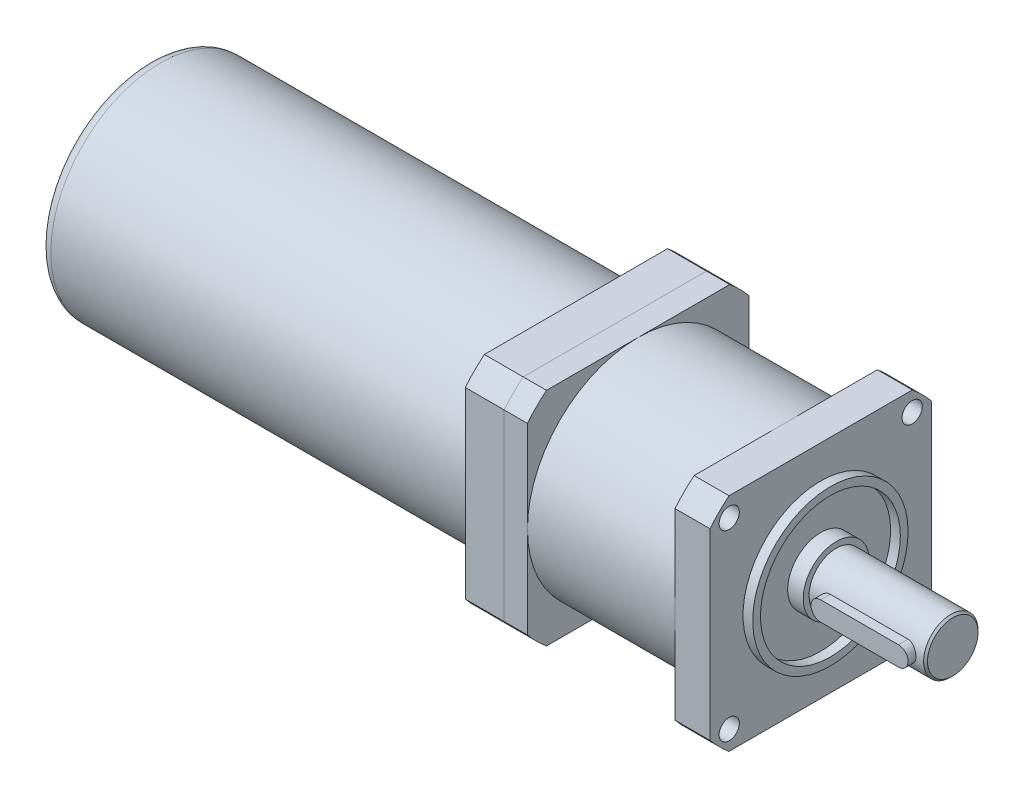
ISO-10303-21;
HEADER;
FILE_DESCRIPTION(('STEP AP214'),'2;1');
FILE_NAME('part.step','',(''),(''),'','','');
FILE_SCHEMA(('AUTOMOTIVE_DESIGN { 1 0 10303 214 1 1 1 1 }'));
ENDSEC;
DATA;
#1=APPLICATION_CONTEXT('core data for automotive mechanical design processes');
#2=APPLICATION_PROTOCOL_DEFINITION('international standard','automotive_design',2000,#1);
#3=PRODUCT_CONTEXT('',#1,'mechanical');
#4=PRODUCT('Part','Part','',(#3));
#5=PRODUCT_RELATED_PRODUCT_CATEGORY('part','',(#4));
#6=PRODUCT_DEFINITION_FORMATION('','',#4);
#7=PRODUCT_DEFINITION_CONTEXT('part definition',#1,'design');
#8=PRODUCT_DEFINITION('design','',#6,#7);
#9=PRODUCT_DEFINITION_SHAPE('','',#8);
#10=(LENGTH_UNIT() NAMED_UNIT(*) SI_UNIT(.MILLI.,.METRE.));
#11=(NAMED_UNIT(*) PLANE_ANGLE_UNIT() SI_UNIT($,.RADIAN.));
#12=(NAMED_UNIT(*) SI_UNIT($,.STERADIAN.) SOLID_ANGLE_UNIT());
#13=UNCERTAINTY_MEASURE_WITH_UNIT(LENGTH_MEASURE(1.E-05),#10,'distance_accuracy_value','');
#14=(GEOMETRIC_REPRESENTATION_CONTEXT(3) GLOBAL_UNCERTAINTY_ASSIGNED_CONTEXT((#13)) GLOBAL_UNIT_ASSIGNED_CONTEXT((#10,
#11,#12)) REPRESENTATION_CONTEXT('',''));
#15=CARTESIAN_POINT('',(0.,0.,0.));
#16=DIRECTION('',(0.,0.,1.));
#17=DIRECTION('',(1.,0.,0.));
#18=AXIS2_PLACEMENT_3D('',#15,#16,#17);
#19=CARTESIAN_POINT('',(-63.,0.,0.));
#20=DIRECTION('',(-1.,0.,0.));
#21=DIRECTION('',(0.,0.,1.));
#22=AXIS2_PLACEMENT_3D('',#19,#20,#21);
#23=PLANE('',#22);
#24=CARTESIAN_POINT('',(-63.,0.,0.));
#25=DIRECTION('',(-1.,0.,0.));
#26=DIRECTION('',(0.,0.,1.));
#27=AXIS2_PLACEMENT_3D('',#24,#25,#26);
#28=CIRCLE('',#27,37.);
#29=CARTESIAN_POINT('',(-63.,28.5,-23.5955504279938));
#30=VERTEX_POINT('',#29);
#31=CARTESIAN_POINT('',(-63.,23.5955504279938,-28.5));
#32=VERTEX_POINT('',#31);
#33=EDGE_CURVE('E156',#30,#32,#28,.T.);
#34=ORIENTED_EDGE('',*,*,#33,.T.);
#35=DIRECTION('',(0.,-1.,0.));
#36=VECTOR('',#35,1.);
#37=CARTESIAN_POINT('',(-63.,-23.5955504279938,-28.5));
#38=LINE('',#37,#36);
#39=CARTESIAN_POINT('',(-63.,-23.5955504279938,-28.5));
#40=VERTEX_POINT('',#39);
#41=EDGE_CURVE('E104',#32,#40,#38,.T.);
#42=ORIENTED_EDGE('',*,*,#41,.T.);
#43=CARTESIAN_POINT('',(-63.,0.,0.));
#44=DIRECTION('',(-1.,0.,0.));
#45=DIRECTION('',(0.,0.,1.));
#46=AXIS2_PLACEMENT_3D('',#43,#44,#45);
#47=CIRCLE('',#46,37.);
#48=CARTESIAN_POINT('',(-63.,-28.5,-23.5955504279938));
#49=VERTEX_POINT('',#48);
#50=EDGE_CURVE('E224',#40,#49,#47,.T.);
#51=ORIENTED_EDGE('',*,*,#50,.T.);
#52=DIRECTION('',(0.,0.,1.));
#53=VECTOR('',#52,1.);
#54=CARTESIAN_POINT('',(-63.,-28.5,-23.5955504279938));
#55=LINE('',#54,#53);
#56=CARTESIAN_POINT('',(-63.,-28.5,23.5955504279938));
#57=VERTEX_POINT('',#56);
#58=EDGE_CURVE('E229',#49,#57,#55,.T.);
#59=ORIENTED_EDGE('',*,*,#58,.T.);
#60=CARTESIAN_POINT('',(-63.,0.,0.));
#61=DIRECTION('',(-1.,0.,0.));
#62=DIRECTION('',(0.,0.,1.));
#63=AXIS2_PLACEMENT_3D('',#60,#61,#62);
#64=CIRCLE('',#63,37.);
#65=CARTESIAN_POINT('',(-63.,-23.5955504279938,28.5));
#66=VERTEX_POINT('',#65);
#67=EDGE_CURVE('E123',#57,#66,#64,.T.);
#68=ORIENTED_EDGE('',*,*,#67,.T.);
#69=DIRECTION('',(0.,1.,0.));
#70=VECTOR('',#69,1.);
#71=CARTESIAN_POINT('',(-63.,-23.5955504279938,28.5));
#72=LINE('',#71,#70);
#73=CARTESIAN_POINT('',(-63.,23.5955504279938,28.5));
#74=VERTEX_POINT('',#73);
#75=EDGE_CURVE('E117',#66,#74,#72,.T.);
#76=ORIENTED_EDGE('',*,*,#75,.T.);
#77=CARTESIAN_POINT('',(-63.,0.,0.));
#78=DIRECTION('',(-1.,0.,0.));
#79=DIRECTION('',(0.,0.,1.));
#80=AXIS2_PLACEMENT_3D('',#77,#78,#79);
#81=CIRCLE('',#80,37.);
#82=CARTESIAN_POINT('',(-63.,28.5,23.5955504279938));
#83=VERTEX_POINT('',#82);
#84=EDGE_CURVE('E121',#74,#83,#81,.T.);
#85=ORIENTED_EDGE('',*,*,#84,.T.);
#86=DIRECTION('',(0.,0.,-1.));
#87=VECTOR('',#86,1.);
#88=CARTESIAN_POINT('',(-63.,28.5,-23.5955504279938));
#89=LINE('',#88,#87);
#90=EDGE_CURVE('E60',#83,#30,#89,.T.);
#91=ORIENTED_EDGE('',*,*,#90,.T.);
#92=EDGE_LOOP('',(#34,#42,#51,#59,#68,#76,#85,#91));
#93=FACE_BOUND('',#92,.T.);
#94=CARTESIAN_POINT('',(-63.,0.,0.));
#95=DIRECTION('',(-1.,0.,0.));
#96=DIRECTION('',(0.,0.,1.));
#97=AXIS2_PLACEMENT_3D('',#94,#95,#96);
#98=CIRCLE('',#97,28.2);
#99=CARTESIAN_POINT('',(-63.,0.,28.2));
#100=VERTEX_POINT('',#99);
#101=EDGE_CURVE('E145',#100,#100,#98,.T.);
#102=ORIENTED_EDGE('',*,*,#101,.F.);
#103=EDGE_LOOP('',(#102));
#104=FACE_BOUND('',#103,.T.);
#105=ADVANCED_FACE('F43',(#93,#104),#23,.T.);
#106=CARTESIAN_POINT('',(-63.,0.,0.));
#107=DIRECTION('',(1.,0.,0.));
#108=DIRECTION('',(0.,0.,-1.));
#109=AXIS2_PLACEMENT_3D('',#106,#107,#108);
#110=CYLINDRICAL_SURFACE('',#109,37.);
#111=CARTESIAN_POINT('',(-53.,0.,0.));
#112=DIRECTION('',(-1.,0.,0.));
#113=DIRECTION('',(0.,0.,1.));
#114=AXIS2_PLACEMENT_3D('',#111,#112,#113);
#115=CIRCLE('',#114,37.);
#116=CARTESIAN_POINT('',(-53.,28.5,-23.5955504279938));
#117=VERTEX_POINT('',#116);
#118=CARTESIAN_POINT('',(-53.,23.5955504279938,-28.5));
#119=VERTEX_POINT('',#118);
#120=EDGE_CURVE('E141',#117,#119,#115,.T.);
#121=ORIENTED_EDGE('',*,*,#120,.T.);
#122=DIRECTION('',(1.,0.,0.));
#123=VECTOR('',#122,1.);
#124=CARTESIAN_POINT('',(-63.,23.5955504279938,-28.5));
#125=LINE('',#124,#123);
#126=EDGE_CURVE('E169',#32,#119,#125,.T.);
#127=ORIENTED_EDGE('',*,*,#126,.F.);
#128=ORIENTED_EDGE('',*,*,#33,.F.);
#129=DIRECTION('',(1.,0.,0.));
#130=VECTOR('',#129,1.);
#131=CARTESIAN_POINT('',(-63.,28.5,-23.5955504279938));
#132=LINE('',#131,#130);
#133=EDGE_CURVE('E137',#30,#117,#132,.T.);
#134=ORIENTED_EDGE('',*,*,#133,.T.);
#135=EDGE_LOOP('',(#121,#127,#128,#134));
#136=FACE_BOUND('',#135,.T.);
#137=ADVANCED_FACE('F184',(#136),#110,.T.);
#138=CARTESIAN_POINT('',(-63.,-23.5955504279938,-28.5));
#139=DIRECTION('',(0.,0.,1.));
#140=DIRECTION('',(1.,0.,0.));
#141=AXIS2_PLACEMENT_3D('',#138,#139,#140);
#142=PLANE('',#141);
#143=DIRECTION('',(0.,-1.,0.));
#144=VECTOR('',#143,1.);
#145=CARTESIAN_POINT('',(-53.,-23.5955504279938,-28.5));
#146=LINE('',#145,#144);
#147=CARTESIAN_POINT('',(-53.,-23.5955504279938,-28.5));
#148=VERTEX_POINT('',#147);
#149=EDGE_CURVE('E144',#119,#148,#146,.T.);
#150=ORIENTED_EDGE('',*,*,#149,.T.);
#151=DIRECTION('',(1.,0.,0.));
#152=VECTOR('',#151,1.);
#153=CARTESIAN_POINT('',(-63.,-23.5955504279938,-28.5));
#154=LINE('',#153,#152);
#155=EDGE_CURVE('E166',#40,#148,#154,.T.);
#156=ORIENTED_EDGE('',*,*,#155,.F.);
#157=ORIENTED_EDGE('',*,*,#41,.F.);
#158=ORIENTED_EDGE('',*,*,#126,.T.);
#159=EDGE_LOOP('',(#150,#156,#157,#158));
#160=FACE_BOUND('',#159,.T.);
#161=ADVANCED_FACE('F189',(#160),#142,.F.);
#162=CARTESIAN_POINT('',(-63.,0.,0.));
#163=DIRECTION('',(1.,0.,0.));
#164=DIRECTION('',(0.,0.,-1.));
#165=AXIS2_PLACEMENT_3D('',#162,#163,#164);
#166=CYLINDRICAL_SURFACE('',#165,37.);
#167=CARTESIAN_POINT('',(-53.,0.,0.));
#168=DIRECTION('',(-1.,0.,0.));
#169=DIRECTION('',(0.,0.,1.));
#170=AXIS2_PLACEMENT_3D('',#167,#168,#169);
#171=CIRCLE('',#170,37.);
#172=CARTESIAN_POINT('',(-53.,-28.5,-23.5955504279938));
#173=VERTEX_POINT('',#172);
#174=EDGE_CURVE('E147',#148,#173,#171,.T.);
#175=ORIENTED_EDGE('',*,*,#174,.T.);
#176=DIRECTION('',(1.,0.,0.));
#177=VECTOR('',#176,1.);
#178=CARTESIAN_POINT('',(-63.,-28.5,-23.5955504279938));
#179=LINE('',#178,#177);
#180=EDGE_CURVE('E163',#49,#173,#179,.T.);
#181=ORIENTED_EDGE('',*,*,#180,.F.);
#182=ORIENTED_EDGE('',*,*,#50,.F.);
#183=ORIENTED_EDGE('',*,*,#155,.T.);
#184=EDGE_LOOP('',(#175,#181,#182,#183));
#185=FACE_BOUND('',#184,.T.);
#186=ADVANCED_FACE('F211',(#185),#166,.T.);
#187=CARTESIAN_POINT('',(-63.,-28.5,-23.5955504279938));
#188=DIRECTION('',(0.,1.,0.));
#189=DIRECTION('',(0.,0.,1.));
#190=AXIS2_PLACEMENT_3D('',#187,#188,#189);
#191=PLANE('',#190);
#192=DIRECTION('',(0.,0.,1.));
#193=VECTOR('',#192,1.);
#194=CARTESIAN_POINT('',(-53.,-28.5,-23.5955504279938));
#195=LINE('',#194,#193);
#196=CARTESIAN_POINT('',(-53.,-28.5,23.5955504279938));
#197=VERTEX_POINT('',#196);
#198=EDGE_CURVE('E149',#173,#197,#195,.T.);
#199=ORIENTED_EDGE('',*,*,#198,.T.);
#200=DIRECTION('',(1.,0.,0.));
#201=VECTOR('',#200,1.);
#202=CARTESIAN_POINT('',(-63.,-28.5,23.5955504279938));
#203=LINE('',#202,#201);
#204=EDGE_CURVE('E160',#57,#197,#203,.T.);
#205=ORIENTED_EDGE('',*,*,#204,.F.);
#206=ORIENTED_EDGE('',*,*,#58,.F.);
#207=ORIENTED_EDGE('',*,*,#180,.T.);
#208=EDGE_LOOP('',(#199,#205,#206,#207));
#209=FACE_BOUND('',#208,.T.);
#210=ADVANCED_FACE('F207',(#209),#191,.F.);
#211=CARTESIAN_POINT('',(-63.,0.,0.));
#212=DIRECTION('',(1.,0.,0.));
#213=DIRECTION('',(0.,0.,-1.));
#214=AXIS2_PLACEMENT_3D('',#211,#212,#213);
#215=CYLINDRICAL_SURFACE('',#214,37.);
#216=CARTESIAN_POINT('',(-53.,0.,0.));
#217=DIRECTION('',(-1.,0.,0.));
#218=DIRECTION('',(0.,0.,1.));
#219=AXIS2_PLACEMENT_3D('',#216,#217,#218);
#220=CIRCLE('',#219,37.);
#221=CARTESIAN_POINT('',(-53.,-23.5955504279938,28.5));
#222=VERTEX_POINT('',#221);
#223=EDGE_CURVE('E151',#197,#222,#220,.T.);
#224=ORIENTED_EDGE('',*,*,#223,.T.);
#225=DIRECTION('',(1.,0.,0.));
#226=VECTOR('',#225,1.);
#227=CARTESIAN_POINT('',(-63.,-23.5955504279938,28.5));
#228=LINE('',#227,#226);
#229=EDGE_CURVE('E132',#66,#222,#228,.T.);
#230=ORIENTED_EDGE('',*,*,#229,.F.);
#231=ORIENTED_EDGE('',*,*,#67,.F.);
#232=ORIENTED_EDGE('',*,*,#204,.T.);
#233=EDGE_LOOP('',(#224,#230,#231,#232));
#234=FACE_BOUND('',#233,.T.);
#235=ADVANCED_FACE('F204',(#234),#215,.T.);
#236=CARTESIAN_POINT('',(-63.,-23.5955504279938,28.5));
#237=DIRECTION('',(0.,0.,-1.));
#238=DIRECTION('',(-1.,0.,0.));
#239=AXIS2_PLACEMENT_3D('',#236,#237,#238);
#240=PLANE('',#239);
#241=DIRECTION('',(0.,1.,0.));
#242=VECTOR('',#241,1.);
#243=CARTESIAN_POINT('',(-53.,-23.5955504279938,28.5));
#244=LINE('',#243,#242);
#245=CARTESIAN_POINT('',(-53.,23.5955504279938,28.5));
#246=VERTEX_POINT('',#245);
#247=EDGE_CURVE('E131',#222,#246,#244,.T.);
#248=ORIENTED_EDGE('',*,*,#247,.T.);
#249=DIRECTION('',(1.,0.,0.));
#250=VECTOR('',#249,1.);
#251=CARTESIAN_POINT('',(-63.,23.5955504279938,28.5));
#252=LINE('',#251,#250);
#253=EDGE_CURVE('E128',#74,#246,#252,.T.);
#254=ORIENTED_EDGE('',*,*,#253,.F.);
#255=ORIENTED_EDGE('',*,*,#75,.F.);
#256=ORIENTED_EDGE('',*,*,#229,.T.);
#257=EDGE_LOOP('',(#248,#254,#255,#256));
#258=FACE_BOUND('',#257,.T.);
#259=ADVANCED_FACE('F129',(#258),#240,.F.);
#260=CARTESIAN_POINT('',(-63.,0.,0.));
#261=DIRECTION('',(1.,0.,0.));
#262=DIRECTION('',(0.,0.,-1.));
#263=AXIS2_PLACEMENT_3D('',#260,#261,#262);
#264=CYLINDRICAL_SURFACE('',#263,37.);
#265=CARTESIAN_POINT('',(-53.,0.,0.));
#266=DIRECTION('',(-1.,0.,0.));
#267=DIRECTION('',(0.,0.,1.));
#268=AXIS2_PLACEMENT_3D('',#265,#266,#267);
#269=CIRCLE('',#268,37.);
#270=CARTESIAN_POINT('',(-53.,28.5,23.5955504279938));
#271=VERTEX_POINT('',#270);
#272=EDGE_CURVE('E89',#246,#271,#269,.T.);
#273=ORIENTED_EDGE('',*,*,#272,.T.);
#274=DIRECTION('',(1.,0.,0.));
#275=VECTOR('',#274,1.);
#276=CARTESIAN_POINT('',(-63.,28.5,23.5955504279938));
#277=LINE('',#276,#275);
#278=EDGE_CURVE('E133',#83,#271,#277,.T.);
#279=ORIENTED_EDGE('',*,*,#278,.F.);
#280=ORIENTED_EDGE('',*,*,#84,.F.);
#281=ORIENTED_EDGE('',*,*,#253,.T.);
#282=EDGE_LOOP('',(#273,#279,#280,#281));
#283=FACE_BOUND('',#282,.T.);
#284=ADVANCED_FACE('F135',(#283),#264,.T.);
#285=CARTESIAN_POINT('',(-63.,28.5,-23.5955504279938));
#286=DIRECTION('',(0.,-1.,0.));
#287=DIRECTION('',(0.,0.,-1.));
#288=AXIS2_PLACEMENT_3D('',#285,#286,#287);
#289=PLANE('',#288);
#290=DIRECTION('',(0.,0.,-1.));
#291=VECTOR('',#290,1.);
#292=CARTESIAN_POINT('',(-53.,28.5,-23.5955504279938));
#293=LINE('',#292,#291);
#294=EDGE_CURVE('E95',#271,#117,#293,.T.);
#295=ORIENTED_EDGE('',*,*,#294,.T.);
#296=ORIENTED_EDGE('',*,*,#133,.F.);
#297=ORIENTED_EDGE('',*,*,#90,.F.);
#298=ORIENTED_EDGE('',*,*,#278,.T.);
#299=EDGE_LOOP('',(#295,#296,#297,#298));
#300=FACE_BOUND('',#299,.T.);
#301=ADVANCED_FACE('F196',(#300),#289,.F.);
#302=CARTESIAN_POINT('',(-53.,0.,0.));
#303=DIRECTION('',(-1.,0.,0.));
#304=DIRECTION('',(0.,0.,1.));
#305=AXIS2_PLACEMENT_3D('',#302,#303,#304);
#306=PLANE('',#305);
#307=ORIENTED_EDGE('',*,*,#120,.F.);
#308=ORIENTED_EDGE('',*,*,#294,.F.);
#309=ORIENTED_EDGE('',*,*,#272,.F.);
#310=ORIENTED_EDGE('',*,*,#247,.F.);
#311=ORIENTED_EDGE('',*,*,#223,.F.);
#312=ORIENTED_EDGE('',*,*,#198,.F.);
#313=ORIENTED_EDGE('',*,*,#174,.F.);
#314=ORIENTED_EDGE('',*,*,#149,.F.);
#315=EDGE_LOOP('',(#307,#308,#309,#310,#311,#312,#313,#314));
#316=FACE_BOUND('',#315,.T.);
#317=ADVANCED_FACE('F193',(#316),#306,.F.);
#318=CARTESIAN_POINT('',(-173.,0.,0.));
#319=DIRECTION('',(1.,0.,0.));
#320=DIRECTION('',(0.,0.,-1.));
#321=AXIS2_PLACEMENT_3D('',#318,#319,#320);
#322=CYLINDRICAL_SURFACE('',#321,28.2);
#323=CARTESIAN_POINT('',(-170.,0.,0.));
#324=DIRECTION('',(-1.,0.,0.));
#325=DIRECTION('',(0.,0.,1.));
#326=AXIS2_PLACEMENT_3D('',#323,#324,#325);
#327=CIRCLE('',#326,28.2);
#328=CARTESIAN_POINT('',(-170.,0.,28.2));
#329=VERTEX_POINT('',#328);
#330=EDGE_CURVE('E12',#329,#329,#327,.F.);
#331=ORIENTED_EDGE('',*,*,#330,.T.);
#332=EDGE_LOOP('',(#331));
#333=FACE_BOUND('',#332,.T.);
#334=ORIENTED_EDGE('',*,*,#101,.T.);
#335=EDGE_LOOP('',(#334));
#336=FACE_BOUND('',#335,.T.);
#337=ADVANCED_FACE('F180',(#333,#336),#322,.T.);
#338=CARTESIAN_POINT('',(-173.,0.,0.));
#339=DIRECTION('',(-1.,0.,0.));
#340=DIRECTION('',(0.,0.,1.));
#341=AXIS2_PLACEMENT_3D('',#338,#339,#340);
#342=PLANE('',#341);
#343=CARTESIAN_POINT('',(-173.,0.,0.));
#344=DIRECTION('',(-1.,0.,0.));
#345=DIRECTION('',(0.,0.,1.));
#346=AXIS2_PLACEMENT_3D('',#343,#344,#345);
#347=CIRCLE('',#346,25.2);
#348=CARTESIAN_POINT('',(-173.,0.,25.2));
#349=VERTEX_POINT('',#348);
#350=EDGE_CURVE('E52',#349,#349,#347,.T.);
#351=ORIENTED_EDGE('',*,*,#350,.T.);
#352=EDGE_LOOP('',(#351));
#353=FACE_BOUND('',#352,.T.);
#354=ADVANCED_FACE('F173',(#353),#342,.T.);
#355=CARTESIAN_POINT('',(-170.,0.,0.));
#356=DIRECTION('',(-1.,0.,0.));
#357=DIRECTION('',(0.,0.,1.));
#358=AXIS2_PLACEMENT_3D('',#355,#356,#357);
#359=TOROIDAL_SURFACE('',#358,25.2,3.);
#360=ORIENTED_EDGE('',*,*,#330,.F.);
#361=EDGE_LOOP('',(#360));
#362=FACE_BOUND('',#361,.T.);
#363=ORIENTED_EDGE('',*,*,#350,.F.);
#364=EDGE_LOOP('',(#363));
#365=FACE_BOUND('',#364,.T.);
#366=ADVANCED_FACE('F45',(#362,#365),#359,.T.);
#367=CLOSED_SHELL('',(#105,#137,#161,#186,#210,#235,#259,#284,#301,#317,#337,#354,#366));
#368=MANIFOLD_SOLID_BREP('B2',#367);
#369=CARTESIAN_POINT('',(4.,0.,0.));
#370=DIRECTION('',(1.,0.,0.));
#371=DIRECTION('',(0.,0.,-1.));
#372=AXIS2_PLACEMENT_3D('',#369,#370,#371);
#373=PLANE('',#372);
#374=CARTESIAN_POINT('',(4.,0.,0.));
#375=DIRECTION('',(1.,0.,0.));
#376=DIRECTION('',(0.,0.,-1.));
#377=AXIS2_PLACEMENT_3D('',#374,#375,#376);
#378=CIRCLE('',#377,8.5);
#379=CARTESIAN_POINT('',(4.,0.,-8.5));
#380=VERTEX_POINT('',#379);
#381=EDGE_CURVE('E508',#380,#380,#378,.T.);
#382=ORIENTED_EDGE('',*,*,#381,.T.);
#383=EDGE_LOOP('',(#382));
#384=FACE_BOUND('',#383,.T.);
#385=CARTESIAN_POINT('',(4.,0.,0.));
#386=DIRECTION('',(1.,0.,0.));
#387=DIRECTION('',(0.,0.,-1.));
#388=AXIS2_PLACEMENT_3D('',#385,#386,#387);
#389=CIRCLE('',#388,7.);
#390=CARTESIAN_POINT('',(4.,0.,-7.));
#391=VERTEX_POINT('',#390);
#392=EDGE_CURVE('E499',#391,#391,#389,.T.);
#393=ORIENTED_EDGE('',*,*,#392,.F.);
#394=EDGE_LOOP('',(#393));
#395=FACE_BOUND('',#394,.T.);
#396=ADVANCED_FACE('F316',(#384,#395),#373,.T.);
#397=CARTESIAN_POINT('',(0.,0.,0.));
#398=DIRECTION('',(1.,0.,0.));
#399=DIRECTION('',(0.,0.,-1.));
#400=AXIS2_PLACEMENT_3D('',#397,#398,#399);
#401=PLANE('',#400);
#402=CARTESIAN_POINT('',(0.,0.,0.));
#403=DIRECTION('',(1.,0.,0.));
#404=DIRECTION('',(0.,0.,-1.));
#405=AXIS2_PLACEMENT_3D('',#402,#403,#404);
#406=CIRCLE('',#405,18.);
#407=CARTESIAN_POINT('',(0.,0.,-18.));
#408=VERTEX_POINT('',#407);
#409=EDGE_CURVE('E688',#408,#408,#406,.F.);
#410=ORIENTED_EDGE('',*,*,#409,.F.);
#411=EDGE_LOOP('',(#410));
#412=FACE_BOUND('',#411,.T.);
#413=CARTESIAN_POINT('',(0.,0.,0.));
#414=DIRECTION('',(1.,0.,0.));
#415=DIRECTION('',(0.,0.,-1.));
#416=AXIS2_PLACEMENT_3D('',#413,#414,#415);
#417=CIRCLE('',#416,8.5);
#418=CARTESIAN_POINT('',(0.,0.,-8.5));
#419=VERTEX_POINT('',#418);
#420=EDGE_CURVE('E502',#419,#419,#417,.T.);
#421=ORIENTED_EDGE('',*,*,#420,.F.);
#422=EDGE_LOOP('',(#421));
#423=FACE_BOUND('',#422,.T.);
#424=ADVANCED_FACE('F723',(#412,#423),#401,.T.);
#425=CARTESIAN_POINT('',(0.,-23.55,23.55));
#426=DIRECTION('',(1.,0.,0.));
#427=DIRECTION('',(0.,0.,-1.));
#428=AXIS2_PLACEMENT_3D('',#425,#426,#427);
#429=CIRCLE('',#428,2.6);
#430=CARTESIAN_POINT('',(0.,-23.55,20.95));
#431=VERTEX_POINT('',#430);
#432=EDGE_CURVE('E520',#431,#431,#429,.T.);
#433=ORIENTED_EDGE('',*,*,#432,.F.);
#434=EDGE_LOOP('',(#433));
#435=FACE_BOUND('',#434,.T.);
#436=CARTESIAN_POINT('',(0.,-23.55,-23.55));
#437=DIRECTION('',(1.,0.,0.));
#438=DIRECTION('',(0.,0.,-1.));
#439=AXIS2_PLACEMENT_3D('',#436,#437,#438);
#440=CIRCLE('',#439,2.6);
#441=CARTESIAN_POINT('',(0.,-23.55,-26.15));
#442=VERTEX_POINT('',#441);
#443=EDGE_CURVE('E526',#442,#442,#440,.T.);
#444=ORIENTED_EDGE('',*,*,#443,.F.);
#445=EDGE_LOOP('',(#444));
#446=FACE_BOUND('',#445,.T.);
#447=CARTESIAN_POINT('',(0.,23.55,-23.55));
#448=DIRECTION('',(1.,0.,0.));
#449=DIRECTION('',(0.,0.,-1.));
#450=AXIS2_PLACEMENT_3D('',#447,#448,#449);
#451=CIRCLE('',#450,2.6);
#452=CARTESIAN_POINT('',(0.,23.55,-26.15));
#453=VERTEX_POINT('',#452);
#454=EDGE_CURVE('E532',#453,#453,#451,.T.);
#455=ORIENTED_EDGE('',*,*,#454,.F.);
#456=EDGE_LOOP('',(#455));
#457=FACE_BOUND('',#456,.T.);
#458=CARTESIAN_POINT('',(0.,23.55,23.55));
#459=DIRECTION('',(1.,0.,0.));
#460=DIRECTION('',(0.,0.,-1.));
#461=AXIS2_PLACEMENT_3D('',#458,#459,#460);
#462=CIRCLE('',#461,2.6);
#463=CARTESIAN_POINT('',(0.,23.55,20.95));
#464=VERTEX_POINT('',#463);
#465=EDGE_CURVE('E538',#464,#464,#462,.T.);
#466=ORIENTED_EDGE('',*,*,#465,.F.);
#467=EDGE_LOOP('',(#466));
#468=FACE_BOUND('',#467,.T.);
#469=CARTESIAN_POINT('',(0.,0.,0.));
#470=DIRECTION('',(1.,0.,0.));
#471=DIRECTION('',(0.,0.,-1.));
#472=AXIS2_PLACEMENT_3D('',#469,#470,#471);
#473=CIRCLE('',#472,37.);
#474=CARTESIAN_POINT('',(0.,23.5955504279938,-28.5));
#475=VERTEX_POINT('',#474);
#476=CARTESIAN_POINT('',(0.,28.5,-23.5955504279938));
#477=VERTEX_POINT('',#476);
#478=EDGE_CURVE('E616',#475,#477,#473,.T.);
#479=ORIENTED_EDGE('',*,*,#478,.T.);
#480=DIRECTION('',(0.,0.,1.));
#481=VECTOR('',#480,1.);
#482=CARTESIAN_POINT('',(0.,28.5,23.5955504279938));
#483=LINE('',#482,#481);
#484=CARTESIAN_POINT('',(0.,28.5,23.5955504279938));
#485=VERTEX_POINT('',#484);
#486=EDGE_CURVE('E653',#477,#485,#483,.T.);
#487=ORIENTED_EDGE('',*,*,#486,.T.);
#488=CARTESIAN_POINT('',(0.,0.,0.));
#489=DIRECTION('',(1.,0.,0.));
#490=DIRECTION('',(0.,0.,-1.));
#491=AXIS2_PLACEMENT_3D('',#488,#489,#490);
#492=CIRCLE('',#491,37.);
#493=CARTESIAN_POINT('',(0.,23.5955504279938,28.5));
#494=VERTEX_POINT('',#493);
#495=EDGE_CURVE('E656',#485,#494,#492,.T.);
#496=ORIENTED_EDGE('',*,*,#495,.T.);
#497=DIRECTION('',(0.,-1.,0.));
#498=VECTOR('',#497,1.);
#499=CARTESIAN_POINT('',(0.,-23.5955504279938,28.5));
#500=LINE('',#499,#498);
#501=CARTESIAN_POINT('',(0.,-23.5955504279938,28.5));
#502=VERTEX_POINT('',#501);
#503=EDGE_CURVE('E659',#494,#502,#500,.T.);
#504=ORIENTED_EDGE('',*,*,#503,.T.);
#505=CARTESIAN_POINT('',(0.,0.,0.));
#506=DIRECTION('',(1.,0.,0.));
#507=DIRECTION('',(0.,0.,-1.));
#508=AXIS2_PLACEMENT_3D('',#505,#506,#507);
#509=CIRCLE('',#508,37.);
#510=CARTESIAN_POINT('',(0.,-28.5,23.5955504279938));
#511=VERTEX_POINT('',#510);
#512=EDGE_CURVE('E662',#502,#511,#509,.T.);
#513=ORIENTED_EDGE('',*,*,#512,.T.);
#514=DIRECTION('',(0.,0.,-1.));
#515=VECTOR('',#514,1.);
#516=CARTESIAN_POINT('',(0.,-28.5,23.5955504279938));
#517=LINE('',#516,#515);
#518=CARTESIAN_POINT('',(0.,-28.5,-23.5955504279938));
#519=VERTEX_POINT('',#518);
#520=EDGE_CURVE('E665',#511,#519,#517,.T.);
#521=ORIENTED_EDGE('',*,*,#520,.T.);
#522=CARTESIAN_POINT('',(0.,0.,0.));
#523=DIRECTION('',(1.,0.,0.));
#524=DIRECTION('',(0.,0.,-1.));
#525=AXIS2_PLACEMENT_3D('',#522,#523,#524);
#526=CIRCLE('',#525,37.);
#527=CARTESIAN_POINT('',(0.,-23.5955504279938,-28.5));
#528=VERTEX_POINT('',#527);
#529=EDGE_CURVE('E668',#519,#528,#526,.T.);
#530=ORIENTED_EDGE('',*,*,#529,.T.);
#531=DIRECTION('',(0.,1.,0.));
#532=VECTOR('',#531,1.);
#533=CARTESIAN_POINT('',(0.,-23.5955504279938,-28.5));
#534=LINE('',#533,#532);
#535=EDGE_CURVE('E626',#528,#475,#534,.T.);
#536=ORIENTED_EDGE('',*,*,#535,.T.);
#537=EDGE_LOOP('',(#479,#487,#496,#504,#513,#521,#530,#536));
#538=FACE_BOUND('',#537,.T.);
#539=CARTESIAN_POINT('',(0.,0.,0.));
#540=DIRECTION('',(1.,0.,0.));
#541=DIRECTION('',(0.,0.,-1.));
#542=AXIS2_PLACEMENT_3D('',#539,#540,#541);
#543=CIRCLE('',#542,20.);
#544=CARTESIAN_POINT('',(0.,0.,-20.));
#545=VERTEX_POINT('',#544);
#546=EDGE_CURVE('E516',#545,#545,#543,.T.);
#547=ORIENTED_EDGE('',*,*,#546,.F.);
#548=EDGE_LOOP('',(#547));
#549=FACE_BOUND('',#548,.T.);
#550=ADVANCED_FACE('F728',(#435,#446,#457,#468,#538,#549),#401,.T.);
#551=CARTESIAN_POINT('',(-9.,0.,0.));
#552=DIRECTION('',(1.,0.,0.));
#553=DIRECTION('',(0.,0.,-1.));
#554=AXIS2_PLACEMENT_3D('',#551,#552,#553);
#555=PLANE('',#554);
#556=CARTESIAN_POINT('',(-9.,23.55,23.55));
#557=DIRECTION('',(1.,0.,0.));
#558=DIRECTION('',(0.,0.,-1.));
#559=AXIS2_PLACEMENT_3D('',#556,#557,#558);
#560=CIRCLE('',#559,2.6);
#561=CARTESIAN_POINT('',(-9.,23.55,20.95));
#562=VERTEX_POINT('',#561);
#563=EDGE_CURVE('E541',#562,#562,#560,.T.);
#564=ORIENTED_EDGE('',*,*,#563,.T.);
#565=EDGE_LOOP('',(#564));
#566=FACE_BOUND('',#565,.T.);
#567=CARTESIAN_POINT('',(-9.,0.,0.));
#568=DIRECTION('',(-1.,0.,0.));
#569=DIRECTION('',(0.,0.,1.));
#570=AXIS2_PLACEMENT_3D('',#567,#568,#569);
#571=CIRCLE('',#570,28.5);
#572=CARTESIAN_POINT('',(-9.,0.,28.5));
#573=VERTEX_POINT('',#572);
#574=CARTESIAN_POINT('',(-9.,28.5,0.));
#575=VERTEX_POINT('',#574);
#576=EDGE_CURVE('E612',#573,#575,#571,.T.);
#577=ORIENTED_EDGE('',*,*,#576,.F.);
#578=DIRECTION('',(0.,-1.,0.));
#579=VECTOR('',#578,1.);
#580=CARTESIAN_POINT('',(-9.,-23.5955504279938,28.5));
#581=LINE('',#580,#579);
#582=CARTESIAN_POINT('',(-9.,23.5955504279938,28.5));
#583=VERTEX_POINT('',#582);
#584=EDGE_CURVE('E634',#583,#573,#581,.T.);
#585=ORIENTED_EDGE('',*,*,#584,.F.);
#586=CARTESIAN_POINT('',(-9.,0.,0.));
#587=DIRECTION('',(1.,0.,0.));
#588=DIRECTION('',(0.,0.,-1.));
#589=AXIS2_PLACEMENT_3D('',#586,#587,#588);
#590=CIRCLE('',#589,37.);
#591=CARTESIAN_POINT('',(-9.,28.5,23.5955504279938));
#592=VERTEX_POINT('',#591);
#593=EDGE_CURVE('E630',#592,#583,#590,.T.);
#594=ORIENTED_EDGE('',*,*,#593,.F.);
#595=DIRECTION('',(0.,0.,1.));
#596=VECTOR('',#595,1.);
#597=CARTESIAN_POINT('',(-9.,28.5,23.5955504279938));
#598=LINE('',#597,#596);
#599=EDGE_CURVE('E625',#575,#592,#598,.T.);
#600=ORIENTED_EDGE('',*,*,#599,.F.);
#601=EDGE_LOOP('',(#577,#585,#594,#600));
#602=FACE_BOUND('',#601,.T.);
#603=ADVANCED_FACE('F810',(#566,#602),#555,.F.);
#604=CARTESIAN_POINT('',(-9.,23.55,-23.55));
#605=DIRECTION('',(1.,0.,0.));
#606=DIRECTION('',(0.,0.,-1.));
#607=AXIS2_PLACEMENT_3D('',#604,#605,#606);
#608=CIRCLE('',#607,2.6);
#609=CARTESIAN_POINT('',(-9.,23.55,-26.15));
#610=VERTEX_POINT('',#609);
#611=EDGE_CURVE('E535',#610,#610,#608,.T.);
#612=ORIENTED_EDGE('',*,*,#611,.T.);
#613=EDGE_LOOP('',(#612));
#614=FACE_BOUND('',#613,.T.);
#615=CARTESIAN_POINT('',(-9.,0.,-28.5));
#616=VERTEX_POINT('',#615);
#617=EDGE_CURVE('E620',#575,#616,#571,.T.);
#618=ORIENTED_EDGE('',*,*,#617,.F.);
#619=CARTESIAN_POINT('',(-9.,28.5,-23.5955504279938));
#620=VERTEX_POINT('',#619);
#621=EDGE_CURVE('E627',#620,#575,#598,.T.);
#622=ORIENTED_EDGE('',*,*,#621,.F.);
#623=CARTESIAN_POINT('',(-9.,0.,0.));
#624=DIRECTION('',(1.,0.,0.));
#625=DIRECTION('',(0.,0.,-1.));
#626=AXIS2_PLACEMENT_3D('',#623,#624,#625);
#627=CIRCLE('',#626,37.);
#628=CARTESIAN_POINT('',(-9.,23.5955504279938,-28.5));
#629=VERTEX_POINT('',#628);
#630=EDGE_CURVE('E622',#629,#620,#627,.T.);
#631=ORIENTED_EDGE('',*,*,#630,.F.);
#632=DIRECTION('',(0.,1.,0.));
#633=VECTOR('',#632,1.);
#634=CARTESIAN_POINT('',(-9.,-23.5955504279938,-28.5));
#635=LINE('',#634,#633);
#636=EDGE_CURVE('E646',#616,#629,#635,.T.);
#637=ORIENTED_EDGE('',*,*,#636,.F.);
#638=EDGE_LOOP('',(#618,#622,#631,#637));
#639=FACE_BOUND('',#638,.T.);
#640=ADVANCED_FACE('F812',(#614,#639),#555,.F.);
#641=CARTESIAN_POINT('',(-9.,-23.55,-23.55));
#642=DIRECTION('',(1.,0.,0.));
#643=DIRECTION('',(0.,0.,-1.));
#644=AXIS2_PLACEMENT_3D('',#641,#642,#643);
#645=CIRCLE('',#644,2.6);
#646=CARTESIAN_POINT('',(-9.,-23.55,-26.15));
#647=VERTEX_POINT('',#646);
#648=EDGE_CURVE('E529',#647,#647,#645,.T.);
#649=ORIENTED_EDGE('',*,*,#648,.T.);
#650=EDGE_LOOP('',(#649));
#651=FACE_BOUND('',#650,.T.);
#652=CARTESIAN_POINT('',(-9.,-28.5,0.));
#653=VERTEX_POINT('',#652);
#654=EDGE_CURVE('E884',#616,#653,#571,.T.);
#655=ORIENTED_EDGE('',*,*,#654,.F.);
#656=CARTESIAN_POINT('',(-9.,-23.5955504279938,-28.5));
#657=VERTEX_POINT('',#656);
#658=EDGE_CURVE('E647',#657,#616,#635,.T.);
#659=ORIENTED_EDGE('',*,*,#658,.F.);
#660=CARTESIAN_POINT('',(-9.,0.,0.));
#661=DIRECTION('',(1.,0.,0.));
#662=DIRECTION('',(0.,0.,-1.));
#663=AXIS2_PLACEMENT_3D('',#660,#661,#662);
#664=CIRCLE('',#663,37.);
#665=CARTESIAN_POINT('',(-9.,-28.5,-23.5955504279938));
#666=VERTEX_POINT('',#665);
#667=EDGE_CURVE('E643',#666,#657,#664,.T.);
#668=ORIENTED_EDGE('',*,*,#667,.F.);
#669=DIRECTION('',(0.,0.,-1.));
#670=VECTOR('',#669,1.);
#671=CARTESIAN_POINT('',(-9.,-28.5,23.5955504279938));
#672=LINE('',#671,#670);
#673=EDGE_CURVE('E639',#653,#666,#672,.T.);
#674=ORIENTED_EDGE('',*,*,#673,.F.);
#675=EDGE_LOOP('',(#655,#659,#668,#674));
#676=FACE_BOUND('',#675,.T.);
#677=ADVANCED_FACE('F848',(#651,#676),#555,.F.);
#678=CARTESIAN_POINT('',(-9.,-23.55,23.55));
#679=DIRECTION('',(1.,0.,0.));
#680=DIRECTION('',(0.,0.,-1.));
#681=AXIS2_PLACEMENT_3D('',#678,#679,#680);
#682=CIRCLE('',#681,2.6);
#683=CARTESIAN_POINT('',(-9.,-23.55,20.95));
#684=VERTEX_POINT('',#683);
#685=EDGE_CURVE('E523',#684,#684,#682,.T.);
#686=ORIENTED_EDGE('',*,*,#685,.T.);
#687=EDGE_LOOP('',(#686));
#688=FACE_BOUND('',#687,.T.);
#689=EDGE_CURVE('E621',#653,#573,#571,.T.);
#690=ORIENTED_EDGE('',*,*,#689,.F.);
#691=CARTESIAN_POINT('',(-9.,-28.5,23.5955504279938));
#692=VERTEX_POINT('',#691);
#693=EDGE_CURVE('E640',#692,#653,#672,.T.);
#694=ORIENTED_EDGE('',*,*,#693,.F.);
#695=CARTESIAN_POINT('',(-9.,0.,0.));
#696=DIRECTION('',(1.,0.,0.));
#697=DIRECTION('',(0.,0.,-1.));
#698=AXIS2_PLACEMENT_3D('',#695,#696,#697);
#699=CIRCLE('',#698,37.);
#700=CARTESIAN_POINT('',(-9.,-23.5955504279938,28.5));
#701=VERTEX_POINT('',#700);
#702=EDGE_CURVE('E636',#701,#692,#699,.T.);
#703=ORIENTED_EDGE('',*,*,#702,.F.);
#704=EDGE_CURVE('E633',#573,#701,#581,.T.);
#705=ORIENTED_EDGE('',*,*,#704,.F.);
#706=EDGE_LOOP('',(#690,#694,#703,#705));
#707=FACE_BOUND('',#706,.T.);
#708=ADVANCED_FACE('F814',(#688,#707),#555,.F.);
#709=CARTESIAN_POINT('',(-9.,0.,0.));
#710=DIRECTION('',(1.,0.,0.));
#711=DIRECTION('',(0.,0.,-1.));
#712=AXIS2_PLACEMENT_3D('',#709,#710,#711);
#713=CYLINDRICAL_SURFACE('',#712,37.);
#714=ORIENTED_EDGE('',*,*,#478,.F.);
#715=DIRECTION('',(1.,0.,0.));
#716=VECTOR('',#715,1.);
#717=CARTESIAN_POINT('',(-9.,23.5955504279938,-28.5));
#718=LINE('',#717,#716);
#719=EDGE_CURVE('E673',#629,#475,#718,.T.);
#720=ORIENTED_EDGE('',*,*,#719,.F.);
#721=ORIENTED_EDGE('',*,*,#630,.T.);
#722=DIRECTION('',(1.,0.,0.));
#723=VECTOR('',#722,1.);
#724=CARTESIAN_POINT('',(-9.,28.5,-23.5955504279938));
#725=LINE('',#724,#723);
#726=EDGE_CURVE('E650',#620,#477,#725,.T.);
#727=ORIENTED_EDGE('',*,*,#726,.T.);
#728=EDGE_LOOP('',(#714,#720,#721,#727));
#729=FACE_BOUND('',#728,.T.);
#730=ADVANCED_FACE('F820',(#729),#713,.T.);
#731=CARTESIAN_POINT('',(-9.,-23.5955504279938,-28.5));
#732=DIRECTION('',(0.,0.,-1.));
#733=DIRECTION('',(-1.,0.,0.));
#734=AXIS2_PLACEMENT_3D('',#731,#732,#733);
#735=PLANE('',#734);
#736=ORIENTED_EDGE('',*,*,#535,.F.);
#737=DIRECTION('',(1.,0.,0.));
#738=VECTOR('',#737,1.);
#739=CARTESIAN_POINT('',(-9.,-23.5955504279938,-28.5));
#740=LINE('',#739,#738);
#741=EDGE_CURVE('E675',#657,#528,#740,.T.);
#742=ORIENTED_EDGE('',*,*,#741,.F.);
#743=ORIENTED_EDGE('',*,*,#658,.T.);
#744=ORIENTED_EDGE('',*,*,#636,.T.);
#745=ORIENTED_EDGE('',*,*,#719,.T.);
#746=EDGE_LOOP('',(#736,#742,#743,#744,#745));
#747=FACE_BOUND('',#746,.T.);
#748=ADVANCED_FACE('F816',(#747),#735,.T.);
#749=CARTESIAN_POINT('',(-9.,0.,0.));
#750=DIRECTION('',(1.,0.,0.));
#751=DIRECTION('',(0.,0.,-1.));
#752=AXIS2_PLACEMENT_3D('',#749,#750,#751);
#753=CYLINDRICAL_SURFACE('',#752,37.);
#754=ORIENTED_EDGE('',*,*,#529,.F.);
#755=DIRECTION('',(1.,0.,0.));
#756=VECTOR('',#755,1.);
#757=CARTESIAN_POINT('',(-9.,-28.5,-23.5955504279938));
#758=LINE('',#757,#756);
#759=EDGE_CURVE('E677',#666,#519,#758,.T.);
#760=ORIENTED_EDGE('',*,*,#759,.F.);
#761=ORIENTED_EDGE('',*,*,#667,.T.);
#762=ORIENTED_EDGE('',*,*,#741,.T.);
#763=EDGE_LOOP('',(#754,#760,#761,#762));
#764=FACE_BOUND('',#763,.T.);
#765=ADVANCED_FACE('F819',(#764),#753,.T.);
#766=CARTESIAN_POINT('',(-9.,-28.5,23.5955504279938));
#767=DIRECTION('',(0.,-1.,0.));
#768=DIRECTION('',(0.,0.,-1.));
#769=AXIS2_PLACEMENT_3D('',#766,#767,#768);
#770=PLANE('',#769);
#771=ORIENTED_EDGE('',*,*,#520,.F.);
#772=DIRECTION('',(1.,0.,0.));
#773=VECTOR('',#772,1.);
#774=CARTESIAN_POINT('',(-9.,-28.5,23.5955504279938));
#775=LINE('',#774,#773);
#776=EDGE_CURVE('E679',#692,#511,#775,.T.);
#777=ORIENTED_EDGE('',*,*,#776,.F.);
#778=ORIENTED_EDGE('',*,*,#693,.T.);
#779=ORIENTED_EDGE('',*,*,#673,.T.);
#780=ORIENTED_EDGE('',*,*,#759,.T.);
#781=EDGE_LOOP('',(#771,#777,#778,#779,#780));
#782=FACE_BOUND('',#781,.T.);
#783=ADVANCED_FACE('F824',(#782),#770,.T.);
#784=CARTESIAN_POINT('',(-9.,0.,0.));
#785=DIRECTION('',(1.,0.,0.));
#786=DIRECTION('',(0.,0.,-1.));
#787=AXIS2_PLACEMENT_3D('',#784,#785,#786);
#788=CYLINDRICAL_SURFACE('',#787,37.);
#789=ORIENTED_EDGE('',*,*,#512,.F.);
#790=DIRECTION('',(1.,0.,0.));
#791=VECTOR('',#790,1.);
#792=CARTESIAN_POINT('',(-9.,-23.5955504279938,28.5));
#793=LINE('',#792,#791);
#794=EDGE_CURVE('E681',#701,#502,#793,.T.);
#795=ORIENTED_EDGE('',*,*,#794,.F.);
#796=ORIENTED_EDGE('',*,*,#702,.T.);
#797=ORIENTED_EDGE('',*,*,#776,.T.);
#798=EDGE_LOOP('',(#789,#795,#796,#797));
#799=FACE_BOUND('',#798,.T.);
#800=ADVANCED_FACE('F828',(#799),#788,.T.);
#801=CARTESIAN_POINT('',(-9.,-23.5955504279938,28.5));
#802=DIRECTION('',(0.,0.,1.));
#803=DIRECTION('',(1.,0.,0.));
#804=AXIS2_PLACEMENT_3D('',#801,#802,#803);
#805=PLANE('',#804);
#806=ORIENTED_EDGE('',*,*,#503,.F.);
#807=DIRECTION('',(1.,0.,0.));
#808=VECTOR('',#807,1.);
#809=CARTESIAN_POINT('',(-9.,23.5955504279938,28.5));
#810=LINE('',#809,#808);
#811=EDGE_CURVE('E683',#583,#494,#810,.T.);
#812=ORIENTED_EDGE('',*,*,#811,.F.);
#813=ORIENTED_EDGE('',*,*,#584,.T.);
#814=ORIENTED_EDGE('',*,*,#704,.T.);
#815=ORIENTED_EDGE('',*,*,#794,.T.);
#816=EDGE_LOOP('',(#806,#812,#813,#814,#815));
#817=FACE_BOUND('',#816,.T.);
#818=ADVANCED_FACE('F832',(#817),#805,.T.);
#819=CARTESIAN_POINT('',(-9.,0.,0.));
#820=DIRECTION('',(1.,0.,0.));
#821=DIRECTION('',(0.,0.,-1.));
#822=AXIS2_PLACEMENT_3D('',#819,#820,#821);
#823=CYLINDRICAL_SURFACE('',#822,37.);
#824=ORIENTED_EDGE('',*,*,#495,.F.);
#825=DIRECTION('',(1.,0.,0.));
#826=VECTOR('',#825,1.);
#827=CARTESIAN_POINT('',(-9.,28.5,23.5955504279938));
#828=LINE('',#827,#826);
#829=EDGE_CURVE('E685',#592,#485,#828,.T.);
#830=ORIENTED_EDGE('',*,*,#829,.F.);
#831=ORIENTED_EDGE('',*,*,#593,.T.);
#832=ORIENTED_EDGE('',*,*,#811,.T.);
#833=EDGE_LOOP('',(#824,#830,#831,#832));
#834=FACE_BOUND('',#833,.T.);
#835=ADVANCED_FACE('F836',(#834),#823,.T.);
#836=CARTESIAN_POINT('',(-9.,28.5,23.5955504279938));
#837=DIRECTION('',(0.,1.,0.));
#838=DIRECTION('',(0.,0.,1.));
#839=AXIS2_PLACEMENT_3D('',#836,#837,#838);
#840=PLANE('',#839);
#841=ORIENTED_EDGE('',*,*,#486,.F.);
#842=ORIENTED_EDGE('',*,*,#726,.F.);
#843=ORIENTED_EDGE('',*,*,#621,.T.);
#844=ORIENTED_EDGE('',*,*,#599,.T.);
#845=ORIENTED_EDGE('',*,*,#829,.T.);
#846=EDGE_LOOP('',(#841,#842,#843,#844,#845));
#847=FACE_BOUND('',#846,.T.);
#848=ADVANCED_FACE('F809',(#847),#840,.T.);
#849=CARTESIAN_POINT('',(-47.,0.,0.));
#850=DIRECTION('',(1.,0.,0.));
#851=DIRECTION('',(0.,0.,-1.));
#852=AXIS2_PLACEMENT_3D('',#849,#850,#851);
#853=CYLINDRICAL_SURFACE('',#852,28.5);
#854=CARTESIAN_POINT('',(-47.,0.,0.));
#855=DIRECTION('',(-1.,0.,0.));
#856=DIRECTION('',(0.,0.,1.));
#857=AXIS2_PLACEMENT_3D('',#854,#855,#856);
#858=CIRCLE('',#857,28.5);
#859=CARTESIAN_POINT('',(-47.,0.,28.5));
#860=VERTEX_POINT('',#859);
#861=CARTESIAN_POINT('',(-47.,28.5,0.));
#862=VERTEX_POINT('',#861);
#863=EDGE_CURVE('E613',#860,#862,#858,.T.);
#864=ORIENTED_EDGE('',*,*,#863,.F.);
#865=CARTESIAN_POINT('',(-47.,-28.5,0.));
#866=VERTEX_POINT('',#865);
#867=EDGE_CURVE('E331',#866,#860,#858,.T.);
#868=ORIENTED_EDGE('',*,*,#867,.F.);
#869=CARTESIAN_POINT('',(-47.,0.,-28.5));
#870=VERTEX_POINT('',#869);
#871=EDGE_CURVE('E335',#870,#866,#858,.T.);
#872=ORIENTED_EDGE('',*,*,#871,.F.);
#873=EDGE_CURVE('E617',#862,#870,#858,.T.);
#874=ORIENTED_EDGE('',*,*,#873,.F.);
#875=EDGE_LOOP('',(#864,#868,#872,#874));
#876=FACE_BOUND('',#875,.T.);
#877=ORIENTED_EDGE('',*,*,#576,.T.);
#878=ORIENTED_EDGE('',*,*,#617,.T.);
#879=ORIENTED_EDGE('',*,*,#654,.T.);
#880=ORIENTED_EDGE('',*,*,#689,.T.);
#881=EDGE_LOOP('',(#877,#878,#879,#880));
#882=FACE_BOUND('',#881,.T.);
#883=ADVANCED_FACE('F773',(#876,#882),#853,.T.);
#884=CARTESIAN_POINT('',(-47.,0.,0.));
#885=DIRECTION('',(-1.,0.,0.));
#886=DIRECTION('',(0.,0.,1.));
#887=AXIS2_PLACEMENT_3D('',#884,#885,#886);
#888=PLANE('',#887);
#889=DIRECTION('',(0.,1.,0.));
#890=VECTOR('',#889,1.);
#891=CARTESIAN_POINT('',(-47.,-23.5955504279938,28.5));
#892=LINE('',#891,#890);
#893=CARTESIAN_POINT('',(-47.,23.5955504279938,28.5));
#894=VERTEX_POINT('',#893);
#895=EDGE_CURVE('E574',#860,#894,#892,.T.);
#896=ORIENTED_EDGE('',*,*,#895,.F.);
#897=ORIENTED_EDGE('',*,*,#863,.T.);
#898=DIRECTION('',(0.,0.,-1.));
#899=VECTOR('',#898,1.);
#900=CARTESIAN_POINT('',(-47.,28.5,-23.5955504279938));
#901=LINE('',#900,#899);
#902=CARTESIAN_POINT('',(-47.,28.5,23.5955504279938));
#903=VERTEX_POINT('',#902);
#904=EDGE_CURVE('E581',#903,#862,#901,.T.);
#905=ORIENTED_EDGE('',*,*,#904,.F.);
#906=CARTESIAN_POINT('',(-47.,0.,0.));
#907=DIRECTION('',(-1.,0.,0.));
#908=DIRECTION('',(0.,0.,1.));
#909=AXIS2_PLACEMENT_3D('',#906,#907,#908);
#910=CIRCLE('',#909,37.);
#911=EDGE_CURVE('E578',#894,#903,#910,.T.);
#912=ORIENTED_EDGE('',*,*,#911,.F.);
#913=EDGE_LOOP('',(#896,#897,#905,#912));
#914=FACE_BOUND('',#913,.T.);
#915=ADVANCED_FACE('F769',(#914),#888,.F.);
#916=CARTESIAN_POINT('',(-47.,28.5,-23.5955504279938));
#917=VERTEX_POINT('',#916);
#918=EDGE_CURVE('E580',#862,#917,#901,.T.);
#919=ORIENTED_EDGE('',*,*,#918,.F.);
#920=ORIENTED_EDGE('',*,*,#873,.T.);
#921=DIRECTION('',(0.,-1.,0.));
#922=VECTOR('',#921,1.);
#923=CARTESIAN_POINT('',(-47.,-23.5955504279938,-28.5));
#924=LINE('',#923,#922);
#925=CARTESIAN_POINT('',(-47.,23.5955504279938,-28.5));
#926=VERTEX_POINT('',#925);
#927=EDGE_CURVE('E551',#926,#870,#924,.T.);
#928=ORIENTED_EDGE('',*,*,#927,.F.);
#929=CARTESIAN_POINT('',(-47.,0.,0.));
#930=DIRECTION('',(-1.,0.,0.));
#931=DIRECTION('',(0.,0.,1.));
#932=AXIS2_PLACEMENT_3D('',#929,#930,#931);
#933=CIRCLE('',#932,37.);
#934=EDGE_CURVE('E584',#917,#926,#933,.T.);
#935=ORIENTED_EDGE('',*,*,#934,.F.);
#936=EDGE_LOOP('',(#919,#920,#928,#935));
#937=FACE_BOUND('',#936,.T.);
#938=ADVANCED_FACE('F772',(#937),#888,.F.);
#939=CARTESIAN_POINT('',(-47.,-23.5955504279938,-28.5));
#940=VERTEX_POINT('',#939);
#941=EDGE_CURVE('E586',#870,#940,#924,.T.);
#942=ORIENTED_EDGE('',*,*,#941,.F.);
#943=ORIENTED_EDGE('',*,*,#871,.T.);
#944=DIRECTION('',(0.,0.,1.));
#945=VECTOR('',#944,1.);
#946=CARTESIAN_POINT('',(-47.,-28.5,-23.5955504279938));
#947=LINE('',#946,#945);
#948=CARTESIAN_POINT('',(-47.,-28.5,-23.5955504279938));
#949=VERTEX_POINT('',#948);
#950=EDGE_CURVE('E569',#949,#866,#947,.T.);
#951=ORIENTED_EDGE('',*,*,#950,.F.);
#952=CARTESIAN_POINT('',(-47.,0.,0.));
#953=DIRECTION('',(-1.,0.,0.));
#954=DIRECTION('',(0.,0.,1.));
#955=AXIS2_PLACEMENT_3D('',#952,#953,#954);
#956=CIRCLE('',#955,37.);
#957=EDGE_CURVE('E544',#940,#949,#956,.T.);
#958=ORIENTED_EDGE('',*,*,#957,.F.);
#959=EDGE_LOOP('',(#942,#943,#951,#958));
#960=FACE_BOUND('',#959,.T.);
#961=ADVANCED_FACE('F1106',(#960),#888,.F.);
#962=CARTESIAN_POINT('',(-47.,-28.5,23.5955504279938));
#963=VERTEX_POINT('',#962);
#964=EDGE_CURVE('E568',#866,#963,#947,.T.);
#965=ORIENTED_EDGE('',*,*,#964,.F.);
#966=ORIENTED_EDGE('',*,*,#867,.T.);
#967=CARTESIAN_POINT('',(-47.,-23.5955504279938,28.5));
#968=VERTEX_POINT('',#967);
#969=EDGE_CURVE('E575',#968,#860,#892,.T.);
#970=ORIENTED_EDGE('',*,*,#969,.F.);
#971=CARTESIAN_POINT('',(-47.,0.,0.));
#972=DIRECTION('',(-1.,0.,0.));
#973=DIRECTION('',(0.,0.,1.));
#974=AXIS2_PLACEMENT_3D('',#971,#972,#973);
#975=CIRCLE('',#974,37.);
#976=EDGE_CURVE('E572',#963,#968,#975,.T.);
#977=ORIENTED_EDGE('',*,*,#976,.F.);
#978=EDGE_LOOP('',(#965,#966,#970,#977));
#979=FACE_BOUND('',#978,.T.);
#980=ADVANCED_FACE('F775',(#979),#888,.F.);
#981=CARTESIAN_POINT('',(-53.,0.,0.));
#982=DIRECTION('',(1.,0.,0.));
#983=DIRECTION('',(0.,0.,-1.));
#984=AXIS2_PLACEMENT_3D('',#981,#982,#983);
#985=CYLINDRICAL_SURFACE('',#984,37.);
#986=ORIENTED_EDGE('',*,*,#957,.T.);
#987=DIRECTION('',(1.,0.,0.));
#988=VECTOR('',#987,1.);
#989=CARTESIAN_POINT('',(-53.,-28.5,-23.5955504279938));
#990=LINE('',#989,#988);
#991=CARTESIAN_POINT('',(-53.,-28.5,-23.5955504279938));
#992=VERTEX_POINT('',#991);
#993=EDGE_CURVE('E609',#992,#949,#990,.T.);
#994=ORIENTED_EDGE('',*,*,#993,.F.);
#995=CARTESIAN_POINT('',(-53.,0.,0.));
#996=DIRECTION('',(-1.,0.,0.));
#997=DIRECTION('',(0.,0.,1.));
#998=AXIS2_PLACEMENT_3D('',#995,#996,#997);
#999=CIRCLE('',#998,37.);
#1000=CARTESIAN_POINT('',(-53.,-23.5955504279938,-28.5));
#1001=VERTEX_POINT('',#1000);
#1002=EDGE_CURVE('E547',#1001,#992,#999,.T.);
#1003=ORIENTED_EDGE('',*,*,#1002,.F.);
#1004=DIRECTION('',(1.,0.,0.));
#1005=VECTOR('',#1004,1.);
#1006=CARTESIAN_POINT('',(-53.,-23.5955504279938,-28.5));
#1007=LINE('',#1006,#1005);
#1008=EDGE_CURVE('E565',#1001,#940,#1007,.T.);
#1009=ORIENTED_EDGE('',*,*,#1008,.T.);
#1010=EDGE_LOOP('',(#986,#994,#1003,#1009));
#1011=FACE_BOUND('',#1010,.T.);
#1012=ADVANCED_FACE('F802',(#1011),#985,.T.);
#1013=CARTESIAN_POINT('',(-53.,-28.5,-23.5955504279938));
#1014=DIRECTION('',(0.,1.,0.));
#1015=DIRECTION('',(0.,0.,1.));
#1016=AXIS2_PLACEMENT_3D('',#1013,#1014,#1015);
#1017=PLANE('',#1016);
#1018=ORIENTED_EDGE('',*,*,#950,.T.);
#1019=ORIENTED_EDGE('',*,*,#964,.T.);
#1020=DIRECTION('',(1.,0.,0.));
#1021=VECTOR('',#1020,1.);
#1022=CARTESIAN_POINT('',(-53.,-28.5,23.5955504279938));
#1023=LINE('',#1022,#1021);
#1024=CARTESIAN_POINT('',(-53.,-28.5,23.5955504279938));
#1025=VERTEX_POINT('',#1024);
#1026=EDGE_CURVE('E606',#1025,#963,#1023,.T.);
#1027=ORIENTED_EDGE('',*,*,#1026,.F.);
#1028=DIRECTION('',(0.,0.,1.));
#1029=VECTOR('',#1028,1.);
#1030=CARTESIAN_POINT('',(-53.,-28.5,-23.5955504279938));
#1031=LINE('',#1030,#1029);
#1032=EDGE_CURVE('E550',#992,#1025,#1031,.T.);
#1033=ORIENTED_EDGE('',*,*,#1032,.F.);
#1034=ORIENTED_EDGE('',*,*,#993,.T.);
#1035=EDGE_LOOP('',(#1018,#1019,#1027,#1033,#1034));
#1036=FACE_BOUND('',#1035,.T.);
#1037=ADVANCED_FACE('F798',(#1036),#1017,.F.);
#1038=CARTESIAN_POINT('',(-53.,0.,0.));
#1039=DIRECTION('',(1.,0.,0.));
#1040=DIRECTION('',(0.,0.,-1.));
#1041=AXIS2_PLACEMENT_3D('',#1038,#1039,#1040);
#1042=CYLINDRICAL_SURFACE('',#1041,37.);
#1043=ORIENTED_EDGE('',*,*,#976,.T.);
#1044=DIRECTION('',(1.,0.,0.));
#1045=VECTOR('',#1044,1.);
#1046=CARTESIAN_POINT('',(-53.,-23.5955504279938,28.5));
#1047=LINE('',#1046,#1045);
#1048=CARTESIAN_POINT('',(-53.,-23.5955504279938,28.5));
#1049=VERTEX_POINT('',#1048);
#1050=EDGE_CURVE('E603',#1049,#968,#1047,.T.);
#1051=ORIENTED_EDGE('',*,*,#1050,.F.);
#1052=CARTESIAN_POINT('',(-53.,0.,0.));
#1053=DIRECTION('',(-1.,0.,0.));
#1054=DIRECTION('',(0.,0.,1.));
#1055=AXIS2_PLACEMENT_3D('',#1052,#1053,#1054);
#1056=CIRCLE('',#1055,37.);
#1057=EDGE_CURVE('E553',#1025,#1049,#1056,.T.);
#1058=ORIENTED_EDGE('',*,*,#1057,.F.);
#1059=ORIENTED_EDGE('',*,*,#1026,.T.);
#1060=EDGE_LOOP('',(#1043,#1051,#1058,#1059));
#1061=FACE_BOUND('',#1060,.T.);
#1062=ADVANCED_FACE('F794',(#1061),#1042,.T.);
#1063=CARTESIAN_POINT('',(-53.,-23.5955504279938,28.5));
#1064=DIRECTION('',(0.,0.,-1.));
#1065=DIRECTION('',(-1.,0.,0.));
#1066=AXIS2_PLACEMENT_3D('',#1063,#1064,#1065);
#1067=PLANE('',#1066);
#1068=ORIENTED_EDGE('',*,*,#969,.T.);
#1069=ORIENTED_EDGE('',*,*,#895,.T.);
#1070=DIRECTION('',(1.,0.,0.));
#1071=VECTOR('',#1070,1.);
#1072=CARTESIAN_POINT('',(-53.,23.5955504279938,28.5));
#1073=LINE('',#1072,#1071);
#1074=CARTESIAN_POINT('',(-53.,23.5955504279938,28.5));
#1075=VERTEX_POINT('',#1074);
#1076=EDGE_CURVE('E600',#1075,#894,#1073,.T.);
#1077=ORIENTED_EDGE('',*,*,#1076,.F.);
#1078=DIRECTION('',(0.,1.,0.));
#1079=VECTOR('',#1078,1.);
#1080=CARTESIAN_POINT('',(-53.,-23.5955504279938,28.5));
#1081=LINE('',#1080,#1079);
#1082=EDGE_CURVE('E555',#1049,#1075,#1081,.T.);
#1083=ORIENTED_EDGE('',*,*,#1082,.F.);
#1084=ORIENTED_EDGE('',*,*,#1050,.T.);
#1085=EDGE_LOOP('',(#1068,#1069,#1077,#1083,#1084));
#1086=FACE_BOUND('',#1085,.T.);
#1087=ADVANCED_FACE('F790',(#1086),#1067,.F.);
#1088=CARTESIAN_POINT('',(-53.,0.,0.));
#1089=DIRECTION('',(1.,0.,0.));
#1090=DIRECTION('',(0.,0.,-1.));
#1091=AXIS2_PLACEMENT_3D('',#1088,#1089,#1090);
#1092=CYLINDRICAL_SURFACE('',#1091,37.);
#1093=ORIENTED_EDGE('',*,*,#911,.T.);
#1094=DIRECTION('',(1.,0.,0.));
#1095=VECTOR('',#1094,1.);
#1096=CARTESIAN_POINT('',(-53.,28.5,23.5955504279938));
#1097=LINE('',#1096,#1095);
#1098=CARTESIAN_POINT('',(-53.,28.5,23.5955504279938));
#1099=VERTEX_POINT('',#1098);
#1100=EDGE_CURVE('E597',#1099,#903,#1097,.T.);
#1101=ORIENTED_EDGE('',*,*,#1100,.F.);
#1102=CARTESIAN_POINT('',(-53.,0.,0.));
#1103=DIRECTION('',(-1.,0.,0.));
#1104=DIRECTION('',(0.,0.,1.));
#1105=AXIS2_PLACEMENT_3D('',#1102,#1103,#1104);
#1106=CIRCLE('',#1105,37.);
#1107=EDGE_CURVE('E557',#1075,#1099,#1106,.T.);
#1108=ORIENTED_EDGE('',*,*,#1107,.F.);
#1109=ORIENTED_EDGE('',*,*,#1076,.T.);
#1110=EDGE_LOOP('',(#1093,#1101,#1108,#1109));
#1111=FACE_BOUND('',#1110,.T.);
#1112=ADVANCED_FACE('F786',(#1111),#1092,.T.);
#1113=CARTESIAN_POINT('',(-53.,28.5,-23.5955504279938));
#1114=DIRECTION('',(0.,-1.,0.));
#1115=DIRECTION('',(0.,0.,-1.));
#1116=AXIS2_PLACEMENT_3D('',#1113,#1114,#1115);
#1117=PLANE('',#1116);
#1118=ORIENTED_EDGE('',*,*,#904,.T.);
#1119=ORIENTED_EDGE('',*,*,#918,.T.);
#1120=DIRECTION('',(1.,0.,0.));
#1121=VECTOR('',#1120,1.);
#1122=CARTESIAN_POINT('',(-53.,28.5,-23.5955504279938));
#1123=LINE('',#1122,#1121);
#1124=CARTESIAN_POINT('',(-53.,28.5,-23.5955504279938));
#1125=VERTEX_POINT('',#1124);
#1126=EDGE_CURVE('E594',#1125,#917,#1123,.T.);
#1127=ORIENTED_EDGE('',*,*,#1126,.F.);
#1128=DIRECTION('',(0.,0.,-1.));
#1129=VECTOR('',#1128,1.);
#1130=CARTESIAN_POINT('',(-53.,28.5,-23.5955504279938));
#1131=LINE('',#1130,#1129);
#1132=EDGE_CURVE('E559',#1099,#1125,#1131,.T.);
#1133=ORIENTED_EDGE('',*,*,#1132,.F.);
#1134=ORIENTED_EDGE('',*,*,#1100,.T.);
#1135=EDGE_LOOP('',(#1118,#1119,#1127,#1133,#1134));
#1136=FACE_BOUND('',#1135,.T.);
#1137=ADVANCED_FACE('F782',(#1136),#1117,.F.);
#1138=CARTESIAN_POINT('',(-53.,0.,0.));
#1139=DIRECTION('',(1.,0.,0.));
#1140=DIRECTION('',(0.,0.,-1.));
#1141=AXIS2_PLACEMENT_3D('',#1138,#1139,#1140);
#1142=CYLINDRICAL_SURFACE('',#1141,37.);
#1143=ORIENTED_EDGE('',*,*,#934,.T.);
#1144=DIRECTION('',(1.,0.,0.));
#1145=VECTOR('',#1144,1.);
#1146=CARTESIAN_POINT('',(-53.,23.5955504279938,-28.5));
#1147=LINE('',#1146,#1145);
#1148=CARTESIAN_POINT('',(-53.,23.5955504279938,-28.5));
#1149=VERTEX_POINT('',#1148);
#1150=EDGE_CURVE('E591',#1149,#926,#1147,.T.);
#1151=ORIENTED_EDGE('',*,*,#1150,.F.);
#1152=CARTESIAN_POINT('',(-53.,0.,0.));
#1153=DIRECTION('',(-1.,0.,0.));
#1154=DIRECTION('',(0.,0.,1.));
#1155=AXIS2_PLACEMENT_3D('',#1152,#1153,#1154);
#1156=CIRCLE('',#1155,37.);
#1157=EDGE_CURVE('E561',#1125,#1149,#1156,.T.);
#1158=ORIENTED_EDGE('',*,*,#1157,.F.);
#1159=ORIENTED_EDGE('',*,*,#1126,.T.);
#1160=EDGE_LOOP('',(#1143,#1151,#1158,#1159));
#1161=FACE_BOUND('',#1160,.T.);
#1162=ADVANCED_FACE('F778',(#1161),#1142,.T.);
#1163=CARTESIAN_POINT('',(-53.,-23.5955504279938,-28.5));
#1164=DIRECTION('',(0.,0.,1.));
#1165=DIRECTION('',(1.,0.,0.));
#1166=AXIS2_PLACEMENT_3D('',#1163,#1164,#1165);
#1167=PLANE('',#1166);
#1168=ORIENTED_EDGE('',*,*,#927,.T.);
#1169=ORIENTED_EDGE('',*,*,#941,.T.);
#1170=ORIENTED_EDGE('',*,*,#1008,.F.);
#1171=DIRECTION('',(0.,-1.,0.));
#1172=VECTOR('',#1171,1.);
#1173=CARTESIAN_POINT('',(-53.,-23.5955504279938,-28.5));
#1174=LINE('',#1173,#1172);
#1175=EDGE_CURVE('E563',#1149,#1001,#1174,.T.);
#1176=ORIENTED_EDGE('',*,*,#1175,.F.);
#1177=ORIENTED_EDGE('',*,*,#1150,.T.);
#1178=EDGE_LOOP('',(#1168,#1169,#1170,#1176,#1177));
#1179=FACE_BOUND('',#1178,.T.);
#1180=ADVANCED_FACE('F767',(#1179),#1167,.F.);
#1181=CARTESIAN_POINT('',(-53.,0.,0.));
#1182=DIRECTION('',(-1.,0.,0.));
#1183=DIRECTION('',(0.,0.,1.));
#1184=AXIS2_PLACEMENT_3D('',#1181,#1182,#1183);
#1185=PLANE('',#1184);
#1186=ORIENTED_EDGE('',*,*,#1002,.T.);
#1187=ORIENTED_EDGE('',*,*,#1032,.T.);
#1188=ORIENTED_EDGE('',*,*,#1057,.T.);
#1189=ORIENTED_EDGE('',*,*,#1082,.T.);
#1190=ORIENTED_EDGE('',*,*,#1107,.T.);
#1191=ORIENTED_EDGE('',*,*,#1132,.T.);
#1192=ORIENTED_EDGE('',*,*,#1157,.T.);
#1193=ORIENTED_EDGE('',*,*,#1175,.T.);
#1194=EDGE_LOOP('',(#1186,#1187,#1188,#1189,#1190,#1191,#1192,#1193));
#1195=FACE_BOUND('',#1194,.T.);
#1196=ADVANCED_FACE('F763',(#1195),#1185,.T.);
#1197=CARTESIAN_POINT('',(-9.,23.55,23.55));
#1198=DIRECTION('',(1.,0.,0.));
#1199=DIRECTION('',(0.,0.,-1.));
#1200=AXIS2_PLACEMENT_3D('',#1197,#1198,#1199);
#1201=CYLINDRICAL_SURFACE('',#1200,2.6);
#1202=ORIENTED_EDGE('',*,*,#563,.F.);
#1203=EDGE_LOOP('',(#1202));
#1204=FACE_BOUND('',#1203,.T.);
#1205=ORIENTED_EDGE('',*,*,#465,.T.);
#1206=EDGE_LOOP('',(#1205));
#1207=FACE_BOUND('',#1206,.T.);
#1208=ADVANCED_FACE('F759',(#1204,#1207),#1201,.F.);
#1209=CARTESIAN_POINT('',(-9.,23.55,-23.55));
#1210=DIRECTION('',(1.,0.,0.));
#1211=DIRECTION('',(0.,0.,-1.));
#1212=AXIS2_PLACEMENT_3D('',#1209,#1210,#1211);
#1213=CYLINDRICAL_SURFACE('',#1212,2.6);
#1214=ORIENTED_EDGE('',*,*,#611,.F.);
#1215=EDGE_LOOP('',(#1214));
#1216=FACE_BOUND('',#1215,.T.);
#1217=ORIENTED_EDGE('',*,*,#454,.T.);
#1218=EDGE_LOOP('',(#1217));
#1219=FACE_BOUND('',#1218,.T.);
#1220=ADVANCED_FACE('F755',(#1216,#1219),#1213,.F.);
#1221=CARTESIAN_POINT('',(-9.,-23.55,-23.55));
#1222=DIRECTION('',(1.,0.,0.));
#1223=DIRECTION('',(0.,0.,-1.));
#1224=AXIS2_PLACEMENT_3D('',#1221,#1222,#1223);
#1225=CYLINDRICAL_SURFACE('',#1224,2.6);
#1226=ORIENTED_EDGE('',*,*,#648,.F.);
#1227=EDGE_LOOP('',(#1226));
#1228=FACE_BOUND('',#1227,.T.);
#1229=ORIENTED_EDGE('',*,*,#443,.T.);
#1230=EDGE_LOOP('',(#1229));
#1231=FACE_BOUND('',#1230,.T.);
#1232=ADVANCED_FACE('F751',(#1228,#1231),#1225,.F.);
#1233=CARTESIAN_POINT('',(-9.,-23.55,23.55));
#1234=DIRECTION('',(1.,0.,0.));
#1235=DIRECTION('',(0.,0.,-1.));
#1236=AXIS2_PLACEMENT_3D('',#1233,#1234,#1235);
#1237=CYLINDRICAL_SURFACE('',#1236,2.6);
#1238=ORIENTED_EDGE('',*,*,#685,.F.);
#1239=EDGE_LOOP('',(#1238));
#1240=FACE_BOUND('',#1239,.T.);
#1241=ORIENTED_EDGE('',*,*,#432,.T.);
#1242=EDGE_LOOP('',(#1241));
#1243=FACE_BOUND('',#1242,.T.);
#1244=ADVANCED_FACE('F744',(#1240,#1243),#1237,.F.);
#1245=CARTESIAN_POINT('',(2.5,0.,0.));
#1246=DIRECTION('',(1.,0.,0.));
#1247=DIRECTION('',(0.,0.,-1.));
#1248=AXIS2_PLACEMENT_3D('',#1245,#1246,#1247);
#1249=PLANE('',#1248);
#1250=CARTESIAN_POINT('',(2.5,0.,0.));
#1251=DIRECTION('',(1.,0.,0.));
#1252=DIRECTION('',(0.,0.,-1.));
#1253=AXIS2_PLACEMENT_3D('',#1250,#1251,#1252);
#1254=CIRCLE('',#1253,20.);
#1255=CARTESIAN_POINT('',(2.5,0.,-20.));
#1256=VERTEX_POINT('',#1255);
#1257=EDGE_CURVE('E517',#1256,#1256,#1254,.T.);
#1258=ORIENTED_EDGE('',*,*,#1257,.T.);
#1259=EDGE_LOOP('',(#1258));
#1260=FACE_BOUND('',#1259,.T.);
#1261=CARTESIAN_POINT('',(2.5,0.,0.));
#1262=DIRECTION('',(1.,0.,0.));
#1263=DIRECTION('',(0.,0.,-1.));
#1264=AXIS2_PLACEMENT_3D('',#1261,#1262,#1263);
#1265=CIRCLE('',#1264,18.);
#1266=CARTESIAN_POINT('',(2.5,0.,-18.));
#1267=VERTEX_POINT('',#1266);
#1268=EDGE_CURVE('E511',#1267,#1267,#1265,.T.);
#1269=ORIENTED_EDGE('',*,*,#1268,.F.);
#1270=EDGE_LOOP('',(#1269));
#1271=FACE_BOUND('',#1270,.T.);
#1272=ADVANCED_FACE('F741',(#1260,#1271),#1249,.T.);
#1273=CARTESIAN_POINT('',(2.5,0.,0.));
#1274=DIRECTION('',(-1.,0.,0.));
#1275=DIRECTION('',(0.,0.,1.));
#1276=AXIS2_PLACEMENT_3D('',#1273,#1274,#1275);
#1277=CYLINDRICAL_SURFACE('',#1276,20.);
#1278=ORIENTED_EDGE('',*,*,#1257,.F.);
#1279=EDGE_LOOP('',(#1278));
#1280=FACE_BOUND('',#1279,.T.);
#1281=ORIENTED_EDGE('',*,*,#546,.T.);
#1282=EDGE_LOOP('',(#1281));
#1283=FACE_BOUND('',#1282,.T.);
#1284=ADVANCED_FACE('F739',(#1280,#1283),#1277,.T.);
#1285=CARTESIAN_POINT('',(2.5,0.,0.));
#1286=DIRECTION('',(-1.,0.,0.));
#1287=DIRECTION('',(0.,0.,1.));
#1288=AXIS2_PLACEMENT_3D('',#1285,#1286,#1287);
#1289=CYLINDRICAL_SURFACE('',#1288,18.);
#1290=ORIENTED_EDGE('',*,*,#1268,.T.);
#1291=EDGE_LOOP('',(#1290));
#1292=FACE_BOUND('',#1291,.T.);
#1293=ORIENTED_EDGE('',*,*,#409,.T.);
#1294=EDGE_LOOP('',(#1293));
#1295=FACE_BOUND('',#1294,.T.);
#1296=ADVANCED_FACE('F735',(#1292,#1295),#1289,.F.);
#1297=CARTESIAN_POINT('',(4.,0.,0.));
#1298=DIRECTION('',(-1.,0.,0.));
#1299=DIRECTION('',(0.,0.,1.));
#1300=AXIS2_PLACEMENT_3D('',#1297,#1298,#1299);
#1301=CYLINDRICAL_SURFACE('',#1300,8.5);
#1302=ORIENTED_EDGE('',*,*,#381,.F.);
#1303=EDGE_LOOP('',(#1302));
#1304=FACE_BOUND('',#1303,.T.);
#1305=ORIENTED_EDGE('',*,*,#420,.T.);
#1306=EDGE_LOOP('',(#1305));
#1307=FACE_BOUND('',#1306,.T.);
#1308=ADVANCED_FACE('F719',(#1304,#1307),#1301,.T.);
#1309=CARTESIAN_POINT('',(34.,0.,0.));
#1310=DIRECTION('',(-1.,0.,0.));
#1311=DIRECTION('',(0.,0.,1.));
#1312=AXIS2_PLACEMENT_3D('',#1309,#1310,#1311);
#1313=CYLINDRICAL_SURFACE('',#1312,7.);
#1314=CARTESIAN_POINT('',(33.5,0.,0.));
#1315=DIRECTION('',(1.,0.,0.));
#1316=DIRECTION('',(0.,0.,-1.));
#1317=AXIS2_PLACEMENT_3D('',#1314,#1315,#1316);
#1318=CIRCLE('',#1317,7.);
#1319=CARTESIAN_POINT('',(33.5,0.,-7.));
#1320=VERTEX_POINT('',#1319);
#1321=EDGE_CURVE('E41',#1320,#1320,#1318,.F.);
#1322=ORIENTED_EDGE('',*,*,#1321,.T.);
#1323=EDGE_LOOP('',(#1322));
#1324=FACE_BOUND('',#1323,.T.);
#1325=DIRECTION('',(-1.,0.,0.));
#1326=VECTOR('',#1325,1.);
#1327=CARTESIAN_POINT('',(34.,2.5,6.53834841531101));
#1328=LINE('',#1327,#1326);
#1329=CARTESIAN_POINT('',(9.,2.5,6.53834841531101));
#1330=VERTEX_POINT('',#1329);
#1331=CARTESIAN_POINT('',(29.,2.5,6.53834841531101));
#1332=VERTEX_POINT('',#1331);
#1333=EDGE_CURVE('E1058',#1330,#1332,#1328,.F.);
#1334=ORIENTED_EDGE('',*,*,#1333,.T.);
#1335=CARTESIAN_POINT('',(29.,2.5,6.53834841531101));
#1336=CARTESIAN_POINT('',(29.0678892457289,2.50000932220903,6.53833653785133));
#1337=CARTESIAN_POINT('',(29.1357719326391,2.49723485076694,6.53940549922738));
#1338=CARTESIAN_POINT('',(29.2710039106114,2.4861910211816,6.54361657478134));
#1339=CARTESIAN_POINT('',(29.3383533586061,2.47792334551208,6.54675805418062));
#1340=CARTESIAN_POINT('',(29.4718214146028,2.456001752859,6.55501217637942));
#1341=CARTESIAN_POINT('',(29.5379433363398,2.44236559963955,6.56011831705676));
#1342=CARTESIAN_POINT('',(29.6687018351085,2.40985115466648,6.57213177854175));
#1343=CARTESIAN_POINT('',(29.7333383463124,2.39097263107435,6.57903917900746));
#1344=CARTESIAN_POINT('',(29.9242643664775,2.32673964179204,6.6021493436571));
#1345=CARTESIAN_POINT('',(30.0477904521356,2.27375112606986,6.62075475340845));
#1346=CARTESIAN_POINT('',(30.284230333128,2.14910757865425,6.6622539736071));
#1347=CARTESIAN_POINT('',(30.3971363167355,2.07743895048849,6.68515090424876));
#1348=CARTESIAN_POINT('',(30.6142152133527,1.91402571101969,6.73379913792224));
#1349=CARTESIAN_POINT('',(30.7178464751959,1.82158337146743,6.75962864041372));
#1350=CARTESIAN_POINT('',(30.9085087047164,1.6207338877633,6.81057592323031));
#1351=CARTESIAN_POINT('',(30.9955365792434,1.51232377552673,6.83569357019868));
#1352=CARTESIAN_POINT('',(31.153089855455,1.27853915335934,6.88331133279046));
#1353=CARTESIAN_POINT('',(31.2230315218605,1.15274833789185,6.90570835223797));
#1354=CARTESIAN_POINT('',(31.3405366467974,0.890250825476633,6.94442357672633));
#1355=CARTESIAN_POINT('',(31.388107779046,0.753547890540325,6.96074386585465));
#1356=CARTESIAN_POINT('',(31.4576406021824,0.478829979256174,6.9849105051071));
#1357=CARTESIAN_POINT('',(31.4805391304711,0.341079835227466,6.99306594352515));
#1358=CARTESIAN_POINT('',(31.5030684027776,0.0634643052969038,7.00108798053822));
#1359=CARTESIAN_POINT('',(31.5027055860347,-0.0764004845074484,7.00095687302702));
#1360=CARTESIAN_POINT('',(31.4792887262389,-0.347593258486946,6.99262258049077));
#1361=CARTESIAN_POINT('',(31.4572552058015,-0.479022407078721,6.98478243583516));
#1362=CARTESIAN_POINT('',(31.3928265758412,-0.736175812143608,6.96237832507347));
#1363=CARTESIAN_POINT('',(31.3504303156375,-0.861899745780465,6.94781397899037));
#1364=CARTESIAN_POINT('',(31.2459530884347,-1.10616102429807,6.91316506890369));
#1365=CARTESIAN_POINT('',(31.1836042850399,-1.22457279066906,6.89300592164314));
#1366=CARTESIAN_POINT('',(31.0412206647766,-1.44953531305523,6.8492335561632));
#1367=CARTESIAN_POINT('',(30.9611804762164,-1.5560824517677,6.82561928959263));
#1368=CARTESIAN_POINT('',(30.7806767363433,-1.7603244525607,6.7759054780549));
#1369=CARTESIAN_POINT('',(30.6793502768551,-1.85724185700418,6.74974055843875));
#1370=CARTESIAN_POINT('',(30.4616726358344,-2.03299914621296,6.69890342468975));
#1371=CARTESIAN_POINT('',(30.3453160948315,-2.11183255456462,6.67423174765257));
#1372=CARTESIAN_POINT('',(30.098057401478,-2.25049860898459,6.62877803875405));
#1373=CARTESIAN_POINT('',(29.9669210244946,-2.30994207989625,6.60807875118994));
#1374=CARTESIAN_POINT('',(29.6956351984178,-2.4055543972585,6.57388213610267));
#1375=CARTESIAN_POINT('',(29.555500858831,-2.44176119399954,6.56037307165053));
#1376=CARTESIAN_POINT('',(29.3449694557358,-2.47705497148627,6.54708542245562));
#1377=CARTESIAN_POINT('',(29.2762636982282,-2.48565347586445,6.54382010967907));
#1378=CARTESIAN_POINT('',(29.1383848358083,-2.49712352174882,6.53944910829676));
#1379=CARTESIAN_POINT('',(29.0692123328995,-2.50000139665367,6.53834103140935));
#1380=CARTESIAN_POINT('',(29.,-2.5,6.53834841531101));
#1381=B_SPLINE_CURVE_WITH_KNOTS('',3,(#1335,#1336,#1337,#1338,#1339,#1340,#1341,#1342,#1343,
#1344,#1345,#1346,#1347,#1348,#1349,#1350,#1351,#1352,#1353,#1354,#1355,#1356,#1357,#1358,#1359,
#1360,#1361,#1362,#1363,#1364,#1365,#1366,#1367,#1368,#1369,#1370,#1371,#1372,#1373,#1374,#1375,
#1376,#1377,#1378,#1379,#1380),.UNSPECIFIED.,.F.,.F.,(4,2,2,2,2,2,2,2,2,2,2,2,2,2,2,2,2,2,2,2,2,
2,4),(0.,0.203591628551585,0.407120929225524,0.609982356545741,0.812852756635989,
1.21793118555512,1.6233052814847,2.0451597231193,2.4670926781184,2.90188398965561,
3.33652604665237,3.75400993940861,4.17137826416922,4.56998920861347,4.96862268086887,
5.37284909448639,5.77719841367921,6.20315837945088,6.6292706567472,7.06347329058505,
7.49696496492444,7.70468580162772,7.91217653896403),.UNSPECIFIED.);
#1382=CARTESIAN_POINT('',(29.,-2.5,6.53834841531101));
#1383=VERTEX_POINT('',#1382);
#1384=EDGE_CURVE('E691',#1332,#1383,#1381,.T.);
#1385=ORIENTED_EDGE('',*,*,#1384,.T.);
#1386=DIRECTION('',(-1.,0.,0.));
#1387=VECTOR('',#1386,1.);
#1388=CARTESIAN_POINT('',(34.,-2.5,6.53834841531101));
#1389=LINE('',#1388,#1387);
#1390=CARTESIAN_POINT('',(9.,-2.5,6.53834841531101));
#1391=VERTEX_POINT('',#1390);
#1392=EDGE_CURVE('E1057',#1383,#1391,#1389,.T.);
#1393=ORIENTED_EDGE('',*,*,#1392,.T.);
#1394=CARTESIAN_POINT('',(9.,-2.5,6.53834841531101));
#1395=CARTESIAN_POINT('',(8.93211075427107,-2.50000932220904,6.53833653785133));
#1396=CARTESIAN_POINT('',(8.86422806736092,-2.49723485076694,6.53940549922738));
#1397=CARTESIAN_POINT('',(8.72899608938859,-2.4861910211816,6.54361657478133));
#1398=CARTESIAN_POINT('',(8.66164664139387,-2.47792334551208,6.54675805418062));
#1399=CARTESIAN_POINT('',(8.52817858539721,-2.456001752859,6.55501217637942));
#1400=CARTESIAN_POINT('',(8.46205666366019,-2.44236559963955,6.56011831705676));
#1401=CARTESIAN_POINT('',(8.33129816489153,-2.40985115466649,6.57213177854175));
#1402=CARTESIAN_POINT('',(8.26666165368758,-2.39097263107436,6.57903917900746));
#1403=CARTESIAN_POINT('',(8.07573563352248,-2.32673964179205,6.60214934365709));
#1404=CARTESIAN_POINT('',(7.95220954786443,-2.27375112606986,6.62075475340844));
#1405=CARTESIAN_POINT('',(7.71576966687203,-2.14910757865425,6.6622539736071));
#1406=CARTESIAN_POINT('',(7.60286368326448,-2.07743895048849,6.68515090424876));
#1407=CARTESIAN_POINT('',(7.38578478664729,-1.9140257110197,6.73379913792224));
#1408=CARTESIAN_POINT('',(7.28215352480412,-1.82158337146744,6.75962864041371));
#1409=CARTESIAN_POINT('',(7.09149129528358,-1.6207338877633,6.81057592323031));
#1410=CARTESIAN_POINT('',(7.00446342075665,-1.51232377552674,6.83569357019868));
#1411=CARTESIAN_POINT('',(6.84691014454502,-1.27853915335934,6.88331133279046));
#1412=CARTESIAN_POINT('',(6.77696847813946,-1.15274833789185,6.90570835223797));
#1413=CARTESIAN_POINT('',(6.6594633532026,-0.890250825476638,6.94442357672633));
#1414=CARTESIAN_POINT('',(6.61189222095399,-0.753547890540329,6.96074386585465));
#1415=CARTESIAN_POINT('',(6.54235939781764,-0.478829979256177,6.9849105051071));
#1416=CARTESIAN_POINT('',(6.51946086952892,-0.341079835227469,6.99306594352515));
#1417=CARTESIAN_POINT('',(6.49693159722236,-0.0634643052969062,7.00108798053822));
#1418=CARTESIAN_POINT('',(6.49729441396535,0.0764004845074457,7.00095687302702));
#1419=CARTESIAN_POINT('',(6.52071127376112,0.347593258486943,6.99262258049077));
#1420=CARTESIAN_POINT('',(6.54274479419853,0.479022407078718,6.98478243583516));
#1421=CARTESIAN_POINT('',(6.60717342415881,0.736175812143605,6.96237832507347));
#1422=CARTESIAN_POINT('',(6.64956968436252,0.861899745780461,6.94781397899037));
#1423=CARTESIAN_POINT('',(6.75404691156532,1.10616102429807,6.91316506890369));
#1424=CARTESIAN_POINT('',(6.81639571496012,1.22457279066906,6.89300592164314));
#1425=CARTESIAN_POINT('',(6.95877933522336,1.44953531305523,6.84923355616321));
#1426=CARTESIAN_POINT('',(7.03881952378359,1.5560824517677,6.82561928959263));
#1427=CARTESIAN_POINT('',(7.2193232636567,1.7603244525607,6.7759054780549));
#1428=CARTESIAN_POINT('',(7.3206497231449,1.85724185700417,6.74974055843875));
#1429=CARTESIAN_POINT('',(7.53832736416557,2.03299914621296,6.69890342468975));
#1430=CARTESIAN_POINT('',(7.65468390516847,2.11183255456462,6.67423174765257));
#1431=CARTESIAN_POINT('',(7.90194259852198,2.25049860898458,6.62877803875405));
#1432=CARTESIAN_POINT('',(8.03307897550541,2.30994207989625,6.60807875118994));
#1433=CARTESIAN_POINT('',(8.30436480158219,2.40555439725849,6.57388213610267));
#1434=CARTESIAN_POINT('',(8.44449914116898,2.44176119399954,6.56037307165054));
#1435=CARTESIAN_POINT('',(8.65503054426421,2.47705497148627,6.54708542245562));
#1436=CARTESIAN_POINT('',(8.72373630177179,2.48565347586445,6.54382010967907));
#1437=CARTESIAN_POINT('',(8.86161516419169,2.49712352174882,6.53944910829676));
#1438=CARTESIAN_POINT('',(8.93078766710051,2.50000139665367,6.53834103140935));
#1439=CARTESIAN_POINT('',(9.,2.5,6.53834841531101));
#1440=B_SPLINE_CURVE_WITH_KNOTS('',3,(#1394,#1395,#1396,#1397,#1398,#1399,#1400,#1401,#1402,
#1403,#1404,#1405,#1406,#1407,#1408,#1409,#1410,#1411,#1412,#1413,#1414,#1415,#1416,#1417,#1418,
#1419,#1420,#1421,#1422,#1423,#1424,#1425,#1426,#1427,#1428,#1429,#1430,#1431,#1432,#1433,#1434,
#1435,#1436,#1437,#1438,#1439),.UNSPECIFIED.,.F.,.F.,(4,2,2,2,2,2,2,2,2,2,2,2,2,2,2,2,2,2,2,2,2,
2,4),(0.,0.203591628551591,0.40712092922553,0.609982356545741,0.812852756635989,
1.21793118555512,1.6233052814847,2.0451597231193,2.4670926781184,2.90188398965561,
3.33652604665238,3.75400993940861,4.17137826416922,4.56998920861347,4.96862268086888,
5.37284909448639,5.77719841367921,6.20315837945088,6.62927065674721,7.06347329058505,
7.49696496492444,7.70468580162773,7.91217653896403),.UNSPECIFIED.);
#1441=EDGE_CURVE('E498',#1391,#1330,#1440,.T.);
#1442=ORIENTED_EDGE('',*,*,#1441,.T.);
#1443=EDGE_LOOP('',(#1334,#1385,#1393,#1442));
#1444=FACE_BOUND('',#1443,.T.);
#1445=ORIENTED_EDGE('',*,*,#392,.T.);
#1446=EDGE_LOOP('',(#1445));
#1447=FACE_BOUND('',#1446,.T.);
#1448=ADVANCED_FACE('F704',(#1324,#1444,#1447),#1313,.T.);
#1449=CARTESIAN_POINT('',(34.,0.,0.));
#1450=DIRECTION('',(1.,0.,0.));
#1451=DIRECTION('',(0.,0.,-1.));
#1452=AXIS2_PLACEMENT_3D('',#1449,#1450,#1451);
#1453=PLANE('',#1452);
#1454=CARTESIAN_POINT('',(34.,0.,0.));
#1455=DIRECTION('',(1.,0.,0.));
#1456=DIRECTION('',(0.,0.,-1.));
#1457=AXIS2_PLACEMENT_3D('',#1454,#1455,#1456);
#1458=CIRCLE('',#1457,6.49999999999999);
#1459=CARTESIAN_POINT('',(34.,0.,-6.49999999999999));
#1460=VERTEX_POINT('',#1459);
#1461=EDGE_CURVE('E324',#1460,#1460,#1458,.T.);
#1462=ORIENTED_EDGE('',*,*,#1461,.T.);
#1463=EDGE_LOOP('',(#1462));
#1464=FACE_BOUND('',#1463,.T.);
#1465=ADVANCED_FACE('F712',(#1464),#1453,.T.);
#1466=CARTESIAN_POINT('',(9.,0.,9.));
#1467=DIRECTION('',(0.,0.,-1.));
#1468=DIRECTION('',(-1.,0.,0.));
#1469=AXIS2_PLACEMENT_3D('',#1466,#1467,#1468);
#1470=CYLINDRICAL_SURFACE('',#1469,2.5);
#1471=DIRECTION('',(0.,0.,-1.));
#1472=VECTOR('',#1471,1.);
#1473=CARTESIAN_POINT('',(9.,2.5,9.));
#1474=LINE('',#1473,#1472);
#1475=CARTESIAN_POINT('',(9.,2.5,9.));
#1476=VERTEX_POINT('',#1475);
#1477=EDGE_CURVE('E1062',#1476,#1330,#1474,.T.);
#1478=ORIENTED_EDGE('',*,*,#1477,.T.);
#1479=ORIENTED_EDGE('',*,*,#1441,.F.);
#1480=DIRECTION('',(0.,0.,-1.));
#1481=VECTOR('',#1480,1.);
#1482=CARTESIAN_POINT('',(9.,-2.5,9.));
#1483=LINE('',#1482,#1481);
#1484=CARTESIAN_POINT('',(9.,-2.5,9.));
#1485=VERTEX_POINT('',#1484);
#1486=EDGE_CURVE('E479',#1485,#1391,#1483,.T.);
#1487=ORIENTED_EDGE('',*,*,#1486,.F.);
#1488=CARTESIAN_POINT('',(9.,0.,9.));
#1489=DIRECTION('',(0.,0.,1.));
#1490=DIRECTION('',(1.,0.,0.));
#1491=AXIS2_PLACEMENT_3D('',#1488,#1489,#1490);
#1492=CIRCLE('',#1491,2.5);
#1493=EDGE_CURVE('E486',#1476,#1485,#1492,.T.);
#1494=ORIENTED_EDGE('',*,*,#1493,.F.);
#1495=EDGE_LOOP('',(#1478,#1479,#1487,#1494));
#1496=FACE_BOUND('',#1495,.T.);
#1497=ADVANCED_FACE('F496',(#1496),#1470,.T.);
#1498=CARTESIAN_POINT('',(29.,-2.5,9.));
#1499=DIRECTION('',(0.,1.,0.));
#1500=DIRECTION('',(-1.,0.,0.));
#1501=AXIS2_PLACEMENT_3D('',#1498,#1499,#1500);
#1502=PLANE('',#1501);
#1503=ORIENTED_EDGE('',*,*,#1486,.T.);
#1504=ORIENTED_EDGE('',*,*,#1392,.F.);
#1505=DIRECTION('',(0.,0.,-1.));
#1506=VECTOR('',#1505,1.);
#1507=CARTESIAN_POINT('',(29.,-2.5,9.));
#1508=LINE('',#1507,#1506);
#1509=CARTESIAN_POINT('',(29.,-2.5,9.));
#1510=VERTEX_POINT('',#1509);
#1511=EDGE_CURVE('E482',#1510,#1383,#1508,.T.);
#1512=ORIENTED_EDGE('',*,*,#1511,.F.);
#1513=DIRECTION('',(1.,0.,0.));
#1514=VECTOR('',#1513,1.);
#1515=CARTESIAN_POINT('',(29.,-2.5,9.));
#1516=LINE('',#1515,#1514);
#1517=EDGE_CURVE('E475',#1485,#1510,#1516,.T.);
#1518=ORIENTED_EDGE('',*,*,#1517,.F.);
#1519=EDGE_LOOP('',(#1503,#1504,#1512,#1518));
#1520=FACE_BOUND('',#1519,.T.);
#1521=ADVANCED_FACE('F477',(#1520),#1502,.F.);
#1522=CARTESIAN_POINT('',(29.,0.,9.));
#1523=DIRECTION('',(0.,0.,-1.));
#1524=DIRECTION('',(-1.,0.,0.));
#1525=AXIS2_PLACEMENT_3D('',#1522,#1523,#1524);
#1526=CYLINDRICAL_SURFACE('',#1525,2.5);
#1527=ORIENTED_EDGE('',*,*,#1511,.T.);
#1528=ORIENTED_EDGE('',*,*,#1384,.F.);
#1529=DIRECTION('',(0.,0.,-1.));
#1530=VECTOR('',#1529,1.);
#1531=CARTESIAN_POINT('',(29.,2.5,9.));
#1532=LINE('',#1531,#1530);
#1533=CARTESIAN_POINT('',(29.,2.5,9.));
#1534=VERTEX_POINT('',#1533);
#1535=EDGE_CURVE('E504',#1534,#1332,#1532,.T.);
#1536=ORIENTED_EDGE('',*,*,#1535,.F.);
#1537=CARTESIAN_POINT('',(29.,0.,9.));
#1538=DIRECTION('',(0.,0.,1.));
#1539=DIRECTION('',(1.,0.,0.));
#1540=AXIS2_PLACEMENT_3D('',#1537,#1538,#1539);
#1541=CIRCLE('',#1540,2.5);
#1542=EDGE_CURVE('E485',#1510,#1534,#1541,.T.);
#1543=ORIENTED_EDGE('',*,*,#1542,.F.);
#1544=EDGE_LOOP('',(#1527,#1528,#1536,#1543));
#1545=FACE_BOUND('',#1544,.T.);
#1546=ADVANCED_FACE('F1006',(#1545),#1526,.T.);
#1547=CARTESIAN_POINT('',(9.,2.5,9.));
#1548=DIRECTION('',(0.,-1.,0.));
#1549=DIRECTION('',(1.,0.,0.));
#1550=AXIS2_PLACEMENT_3D('',#1547,#1548,#1549);
#1551=PLANE('',#1550);
#1552=ORIENTED_EDGE('',*,*,#1535,.T.);
#1553=ORIENTED_EDGE('',*,*,#1333,.F.);
#1554=ORIENTED_EDGE('',*,*,#1477,.F.);
#1555=DIRECTION('',(-1.,0.,0.));
#1556=VECTOR('',#1555,1.);
#1557=CARTESIAN_POINT('',(9.,2.5,9.));
#1558=LINE('',#1557,#1556);
#1559=EDGE_CURVE('E491',#1534,#1476,#1558,.T.);
#1560=ORIENTED_EDGE('',*,*,#1559,.F.);
#1561=EDGE_LOOP('',(#1552,#1553,#1554,#1560));
#1562=FACE_BOUND('',#1561,.T.);
#1563=ADVANCED_FACE('F1002',(#1562),#1551,.F.);
#1564=CARTESIAN_POINT('',(9.,0.,9.));
#1565=DIRECTION('',(0.,0.,1.));
#1566=DIRECTION('',(1.,0.,0.));
#1567=AXIS2_PLACEMENT_3D('',#1564,#1565,#1566);
#1568=PLANE('',#1567);
#1569=ORIENTED_EDGE('',*,*,#1493,.T.);
#1570=ORIENTED_EDGE('',*,*,#1517,.T.);
#1571=ORIENTED_EDGE('',*,*,#1542,.T.);
#1572=ORIENTED_EDGE('',*,*,#1559,.T.);
#1573=EDGE_LOOP('',(#1569,#1570,#1571,#1572));
#1574=FACE_BOUND('',#1573,.T.);
#1575=ADVANCED_FACE('F489',(#1574),#1568,.T.);
#1576=CARTESIAN_POINT('',(34.,0.,0.));
#1577=DIRECTION('',(-1.,0.,0.));
#1578=DIRECTION('',(0.,0.,1.));
#1579=AXIS2_PLACEMENT_3D('',#1576,#1577,#1578);
#1580=CONICAL_SURFACE('',#1579,6.49999999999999,0.785398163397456);
#1581=ORIENTED_EDGE('',*,*,#1321,.F.);
#1582=EDGE_LOOP('',(#1581));
#1583=FACE_BOUND('',#1582,.T.);
#1584=ORIENTED_EDGE('',*,*,#1461,.F.);
#1585=EDGE_LOOP('',(#1584));
#1586=FACE_BOUND('',#1585,.T.);
#1587=ADVANCED_FACE('F318',(#1583,#1586),#1580,.T.);
#1588=CLOSED_SHELL('',(#396,#424,#550,#603,#640,#677,#708,#730,#748,#765,#783,#800,#818,#835,
#848,#883,#915,#938,#961,#980,#1012,#1037,#1062,#1087,#1112,#1137,#1162,#1180,#1196,#1208,#1220,
#1232,#1244,#1272,#1284,#1296,#1308,#1448,#1465,#1497,#1521,#1546,#1563,#1575,#1587));
#1589=MANIFOLD_SOLID_BREP('B6',#1588);
#1590=ADVANCED_BREP_SHAPE_REPRESENTATION('',(#18,#368,#1589),#14);
#1591=SHAPE_DEFINITION_REPRESENTATION(#9,#1590);
ENDSEC;
END-ISO-10303-21;
